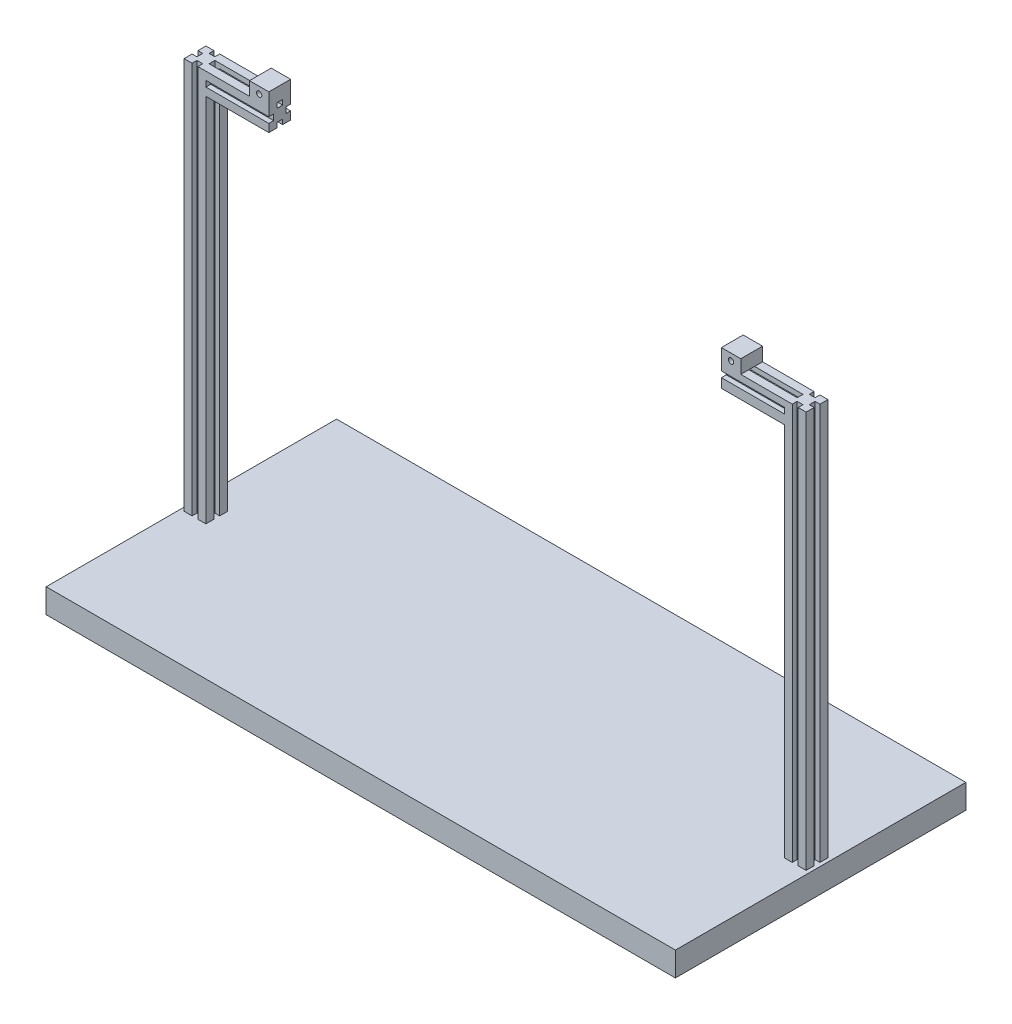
ISO-10303-21;
HEADER;
FILE_DESCRIPTION(('STEP AP214'),'2;1');
FILE_NAME('part.step','',(''),(''),'','','');
FILE_SCHEMA(('AUTOMOTIVE_DESIGN { 1 0 10303 214 1 1 1 1 }'));
ENDSEC;
DATA;
#1=APPLICATION_CONTEXT('core data for automotive mechanical design processes');
#2=APPLICATION_PROTOCOL_DEFINITION('international standard','automotive_design',2000,#1);
#3=PRODUCT_CONTEXT('',#1,'mechanical');
#4=PRODUCT('Part','Part','',(#3));
#5=PRODUCT_RELATED_PRODUCT_CATEGORY('part','',(#4));
#6=PRODUCT_DEFINITION_FORMATION('','',#4);
#7=PRODUCT_DEFINITION_CONTEXT('part definition',#1,'design');
#8=PRODUCT_DEFINITION('design','',#6,#7);
#9=PRODUCT_DEFINITION_SHAPE('','',#8);
#10=(LENGTH_UNIT() NAMED_UNIT(*) SI_UNIT(.MILLI.,.METRE.));
#11=(NAMED_UNIT(*) PLANE_ANGLE_UNIT() SI_UNIT($,.RADIAN.));
#12=(NAMED_UNIT(*) SI_UNIT($,.STERADIAN.) SOLID_ANGLE_UNIT());
#13=UNCERTAINTY_MEASURE_WITH_UNIT(LENGTH_MEASURE(1.E-05),#10,'distance_accuracy_value','');
#14=(GEOMETRIC_REPRESENTATION_CONTEXT(3) GLOBAL_UNCERTAINTY_ASSIGNED_CONTEXT((#13)) GLOBAL_UNIT_ASSIGNED_CONTEXT((#10,
#11,#12)) REPRESENTATION_CONTEXT('',''));
#15=CARTESIAN_POINT('',(0.,0.,0.));
#16=DIRECTION('',(0.,0.,1.));
#17=DIRECTION('',(1.,0.,0.));
#18=AXIS2_PLACEMENT_3D('',#15,#16,#17);
#19=CARTESIAN_POINT('',(-597.5,860.,0.));
#20=DIRECTION('',(1.,0.,0.));
#21=DIRECTION('',(0.,0.,-1.));
#22=AXIS2_PLACEMENT_3D('',#19,#20,#21);
#23=PLANE('',#22);
#24=DIRECTION('',(0.,-1.,0.));
#25=VECTOR('',#24,1.);
#26=CARTESIAN_POINT('',(-597.5,0.,12.5));
#27=LINE('',#26,#25);
#28=CARTESIAN_POINT('',(-597.5,843.5,12.5));
#29=VERTEX_POINT('',#28);
#30=CARTESIAN_POINT('',(-597.5,831.5,12.5));
#31=VERTEX_POINT('',#30);
#32=EDGE_CURVE('E734',#29,#31,#27,.T.);
#33=ORIENTED_EDGE('',*,*,#32,.F.);
#34=DIRECTION('',(0.,0.,-1.));
#35=VECTOR('',#34,1.);
#36=CARTESIAN_POINT('',(-597.5,843.5,0.));
#37=LINE('',#36,#35);
#38=CARTESIAN_POINT('',(-597.5,843.5,22.5));
#39=VERTEX_POINT('',#38);
#40=EDGE_CURVE('E731',#39,#29,#37,.T.);
#41=ORIENTED_EDGE('',*,*,#40,.F.);
#42=DIRECTION('',(0.,-1.,0.));
#43=VECTOR('',#42,1.);
#44=CARTESIAN_POINT('',(-597.5,860.,22.5));
#45=LINE('',#44,#43);
#46=CARTESIAN_POINT('',(-597.5,831.5,22.5));
#47=VERTEX_POINT('',#46);
#48=EDGE_CURVE('E1087',#39,#47,#45,.T.);
#49=ORIENTED_EDGE('',*,*,#48,.T.);
#50=DIRECTION('',(0.,0.,-1.));
#51=VECTOR('',#50,1.);
#52=CARTESIAN_POINT('',(-597.5,831.5,0.));
#53=LINE('',#52,#51);
#54=EDGE_CURVE('E742',#47,#31,#53,.T.);
#55=ORIENTED_EDGE('',*,*,#54,.T.);
#56=EDGE_LOOP('',(#33,#41,#49,#55));
#57=FACE_BOUND('',#56,.T.);
#58=ADVANCED_FACE('F35',(#57),#23,.T.);
#59=DIRECTION('',(0.,-1.,0.));
#60=VECTOR('',#59,1.);
#61=CARTESIAN_POINT('',(-597.5,0.,-12.5000000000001));
#62=LINE('',#61,#60);
#63=CARTESIAN_POINT('',(-597.5,843.5,-12.5));
#64=VERTEX_POINT('',#63);
#65=CARTESIAN_POINT('',(-597.5,831.5,-12.5));
#66=VERTEX_POINT('',#65);
#67=EDGE_CURVE('E754',#64,#66,#62,.T.);
#68=ORIENTED_EDGE('',*,*,#67,.T.);
#69=DIRECTION('',(0.,0.,1.));
#70=VECTOR('',#69,1.);
#71=CARTESIAN_POINT('',(-597.5,831.5,0.));
#72=LINE('',#71,#70);
#73=CARTESIAN_POINT('',(-597.5,831.5,-22.5));
#74=VERTEX_POINT('',#73);
#75=EDGE_CURVE('E751',#74,#66,#72,.T.);
#76=ORIENTED_EDGE('',*,*,#75,.F.);
#77=DIRECTION('',(0.,-1.,0.));
#78=VECTOR('',#77,1.);
#79=CARTESIAN_POINT('',(-597.5,860.,-22.5));
#80=LINE('',#79,#78);
#81=CARTESIAN_POINT('',(-597.5,843.5,-22.5));
#82=VERTEX_POINT('',#81);
#83=EDGE_CURVE('E1223',#82,#74,#80,.T.);
#84=ORIENTED_EDGE('',*,*,#83,.F.);
#85=DIRECTION('',(0.,0.,1.));
#86=VECTOR('',#85,1.);
#87=CARTESIAN_POINT('',(-597.5,843.5,0.));
#88=LINE('',#87,#86);
#89=EDGE_CURVE('E619',#82,#64,#88,.T.);
#90=ORIENTED_EDGE('',*,*,#89,.T.);
#91=EDGE_LOOP('',(#68,#76,#84,#90));
#92=FACE_BOUND('',#91,.T.);
#93=ADVANCED_FACE('F1363',(#92),#23,.T.);
#94=CARTESIAN_POINT('',(597.5,870.,-1.47412946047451E-12));
#95=DIRECTION('',(1.,0.,0.));
#96=DIRECTION('',(0.,0.,-1.));
#97=AXIS2_PLACEMENT_3D('',#94,#95,#96);
#98=PLANE('',#97);
#99=DIRECTION('',(0.,0.,1.));
#100=VECTOR('',#99,1.);
#101=CARTESIAN_POINT('',(597.5,825.,-1.51749672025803E-12));
#102=LINE('',#101,#100);
#103=CARTESIAN_POINT('',(597.5,825.,-22.5));
#104=VERTEX_POINT('',#103);
#105=CARTESIAN_POINT('',(597.5,825.,-5.99999999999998));
#106=VERTEX_POINT('',#105);
#107=EDGE_CURVE('E843',#104,#106,#102,.T.);
#108=ORIENTED_EDGE('',*,*,#107,.F.);
#109=DIRECTION('',(0.,-1.,0.));
#110=VECTOR('',#109,1.);
#111=CARTESIAN_POINT('',(597.5,870.,-22.5));
#112=LINE('',#111,#110);
#113=CARTESIAN_POINT('',(597.5,50.,-22.5));
#114=VERTEX_POINT('',#113);
#115=EDGE_CURVE('E1031',#104,#114,#112,.T.);
#116=ORIENTED_EDGE('',*,*,#115,.T.);
#117=DIRECTION('',(0.,0.,1.));
#118=VECTOR('',#117,1.);
#119=CARTESIAN_POINT('',(597.5,50.,-1.47412946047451E-12));
#120=LINE('',#119,#118);
#121=CARTESIAN_POINT('',(597.5,50.,-5.99999999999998));
#122=VERTEX_POINT('',#121);
#123=EDGE_CURVE('E958',#114,#122,#120,.T.);
#124=ORIENTED_EDGE('',*,*,#123,.T.);
#125=DIRECTION('',(0.,-1.,0.));
#126=VECTOR('',#125,1.);
#127=CARTESIAN_POINT('',(597.5,870.,-5.99999999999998));
#128=LINE('',#127,#126);
#129=EDGE_CURVE('E1029',#106,#122,#128,.T.);
#130=ORIENTED_EDGE('',*,*,#129,.F.);
#131=EDGE_LOOP('',(#108,#116,#124,#130));
#132=FACE_BOUND('',#131,.T.);
#133=ADVANCED_FACE('F1375',(#132),#98,.F.);
#134=DIRECTION('',(0.,0.,1.));
#135=VECTOR('',#134,1.);
#136=CARTESIAN_POINT('',(597.5,825.,-1.51749672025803E-12));
#137=LINE('',#136,#135);
#138=CARTESIAN_POINT('',(597.5,825.,6.00000000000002));
#139=VERTEX_POINT('',#138);
#140=CARTESIAN_POINT('',(597.5,825.,22.5));
#141=VERTEX_POINT('',#140);
#142=EDGE_CURVE('E848',#139,#141,#137,.T.);
#143=ORIENTED_EDGE('',*,*,#142,.F.);
#144=DIRECTION('',(0.,-1.,0.));
#145=VECTOR('',#144,1.);
#146=CARTESIAN_POINT('',(597.5,870.,6.00000000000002));
#147=LINE('',#146,#145);
#148=CARTESIAN_POINT('',(597.5,50.,6.00000000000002));
#149=VERTEX_POINT('',#148);
#150=EDGE_CURVE('E1021',#139,#149,#147,.T.);
#151=ORIENTED_EDGE('',*,*,#150,.T.);
#152=CARTESIAN_POINT('',(597.5,50.,22.5));
#153=VERTEX_POINT('',#152);
#154=EDGE_CURVE('E962',#149,#153,#120,.T.);
#155=ORIENTED_EDGE('',*,*,#154,.T.);
#156=DIRECTION('',(0.,-1.,0.));
#157=VECTOR('',#156,1.);
#158=CARTESIAN_POINT('',(597.5,870.,22.5));
#159=LINE('',#158,#157);
#160=EDGE_CURVE('E1018',#141,#153,#159,.T.);
#161=ORIENTED_EDGE('',*,*,#160,.F.);
#162=EDGE_LOOP('',(#143,#151,#155,#161));
#163=FACE_BOUND('',#162,.T.);
#164=ADVANCED_FACE('F1807',(#163),#98,.F.);
#165=DIRECTION('',(0.,0.,-1.));
#166=VECTOR('',#165,1.);
#167=CARTESIAN_POINT('',(597.5,844.165156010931,-1.51749672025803E-12));
#168=LINE('',#167,#166);
#169=CARTESIAN_POINT('',(597.5,844.165156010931,22.5));
#170=VERTEX_POINT('',#169);
#171=CARTESIAN_POINT('',(597.5,844.165156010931,12.5));
#172=VERTEX_POINT('',#171);
#173=EDGE_CURVE('E851',#170,#172,#168,.T.);
#174=ORIENTED_EDGE('',*,*,#173,.F.);
#175=CARTESIAN_POINT('',(597.5,856.165156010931,22.5));
#176=VERTEX_POINT('',#175);
#177=EDGE_CURVE('E1020',#176,#170,#159,.T.);
#178=ORIENTED_EDGE('',*,*,#177,.F.);
#179=DIRECTION('',(0.,0.,-1.));
#180=VECTOR('',#179,1.);
#181=CARTESIAN_POINT('',(597.5,856.165156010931,-1.51749672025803E-12));
#182=LINE('',#181,#180);
#183=CARTESIAN_POINT('',(597.5,856.165156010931,12.5));
#184=VERTEX_POINT('',#183);
#185=EDGE_CURVE('E857',#176,#184,#182,.T.);
#186=ORIENTED_EDGE('',*,*,#185,.T.);
#187=DIRECTION('',(0.,-1.,0.));
#188=VECTOR('',#187,1.);
#189=CARTESIAN_POINT('',(597.5,0.,12.5));
#190=LINE('',#189,#188);
#191=EDGE_CURVE('E854',#184,#172,#190,.T.);
#192=ORIENTED_EDGE('',*,*,#191,.T.);
#193=EDGE_LOOP('',(#174,#178,#186,#192));
#194=FACE_BOUND('',#193,.T.);
#195=ADVANCED_FACE('F1152',(#194),#98,.F.);
#196=CARTESIAN_POINT('',(0.,50.,0.));
#197=DIRECTION('',(0.,1.,0.));
#198=DIRECTION('',(0.,0.,1.));
#199=AXIS2_PLACEMENT_3D('',#196,#197,#198);
#200=PLANE('',#199);
#201=DIRECTION('',(1.,0.,0.));
#202=VECTOR('',#201,1.);
#203=CARTESIAN_POINT('',(0.,50.,-22.4999999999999));
#204=LINE('',#203,#202);
#205=CARTESIAN_POINT('',(626.,50.,-22.5));
#206=VERTEX_POINT('',#205);
#207=CARTESIAN_POINT('',(642.5,50.,-22.5));
#208=VERTEX_POINT('',#207);
#209=EDGE_CURVE('E904',#206,#208,#204,.T.);
#210=ORIENTED_EDGE('',*,*,#209,.T.);
#211=DIRECTION('',(0.,0.,1.));
#212=VECTOR('',#211,1.);
#213=CARTESIAN_POINT('',(642.5,50.,0.));
#214=LINE('',#213,#212);
#215=CARTESIAN_POINT('',(642.5,50.,-5.99999999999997));
#216=VERTEX_POINT('',#215);
#217=EDGE_CURVE('E910',#208,#216,#214,.T.);
#218=ORIENTED_EDGE('',*,*,#217,.T.);
#219=DIRECTION('',(-1.,0.,0.));
#220=VECTOR('',#219,1.);
#221=CARTESIAN_POINT('',(0.,50.,-5.99999999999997));
#222=LINE('',#221,#220);
#223=CARTESIAN_POINT('',(632.5,50.,-5.99999999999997));
#224=VERTEX_POINT('',#223);
#225=EDGE_CURVE('E986',#216,#224,#222,.T.);
#226=ORIENTED_EDGE('',*,*,#225,.T.);
#227=DIRECTION('',(0.,0.,1.));
#228=VECTOR('',#227,1.);
#229=CARTESIAN_POINT('',(632.5,50.,0.));
#230=LINE('',#229,#228);
#231=CARTESIAN_POINT('',(632.5,50.,6.00000000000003));
#232=VERTEX_POINT('',#231);
#233=EDGE_CURVE('E984',#224,#232,#230,.T.);
#234=ORIENTED_EDGE('',*,*,#233,.T.);
#235=DIRECTION('',(-1.,0.,0.));
#236=VECTOR('',#235,1.);
#237=CARTESIAN_POINT('',(0.,50.,6.00000000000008));
#238=LINE('',#237,#236);
#239=CARTESIAN_POINT('',(642.5,50.,6.00000000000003));
#240=VERTEX_POINT('',#239);
#241=EDGE_CURVE('E981',#240,#232,#238,.T.);
#242=ORIENTED_EDGE('',*,*,#241,.F.);
#243=CARTESIAN_POINT('',(642.5,50.,22.5));
#244=VERTEX_POINT('',#243);
#245=EDGE_CURVE('E979',#240,#244,#214,.T.);
#246=ORIENTED_EDGE('',*,*,#245,.T.);
#247=DIRECTION('',(1.,0.,0.));
#248=VECTOR('',#247,1.);
#249=CARTESIAN_POINT('',(0.,50.,22.5));
#250=LINE('',#249,#248);
#251=CARTESIAN_POINT('',(626.,50.,22.5));
#252=VERTEX_POINT('',#251);
#253=EDGE_CURVE('E972',#252,#244,#250,.T.);
#254=ORIENTED_EDGE('',*,*,#253,.F.);
#255=DIRECTION('',(0.,0.,-1.));
#256=VECTOR('',#255,1.);
#257=CARTESIAN_POINT('',(626.,50.,0.));
#258=LINE('',#257,#256);
#259=CARTESIAN_POINT('',(626.,50.,12.5));
#260=VERTEX_POINT('',#259);
#261=EDGE_CURVE('E977',#252,#260,#258,.T.);
#262=ORIENTED_EDGE('',*,*,#261,.T.);
#263=DIRECTION('',(-1.,0.,0.));
#264=VECTOR('',#263,1.);
#265=CARTESIAN_POINT('',(0.,50.,12.5000000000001));
#266=LINE('',#265,#264);
#267=CARTESIAN_POINT('',(614.,50.,12.5));
#268=VERTEX_POINT('',#267);
#269=EDGE_CURVE('E975',#260,#268,#266,.T.);
#270=ORIENTED_EDGE('',*,*,#269,.T.);
#271=DIRECTION('',(0.,0.,-1.));
#272=VECTOR('',#271,1.);
#273=CARTESIAN_POINT('',(614.,50.,0.));
#274=LINE('',#273,#272);
#275=CARTESIAN_POINT('',(614.,50.,22.5));
#276=VERTEX_POINT('',#275);
#277=EDGE_CURVE('E971',#276,#268,#274,.T.);
#278=ORIENTED_EDGE('',*,*,#277,.F.);
#279=EDGE_CURVE('E969',#153,#276,#250,.T.);
#280=ORIENTED_EDGE('',*,*,#279,.F.);
#281=ORIENTED_EDGE('',*,*,#154,.F.);
#282=DIRECTION('',(1.,0.,0.));
#283=VECTOR('',#282,1.);
#284=CARTESIAN_POINT('',(0.,50.,6.00000000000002));
#285=LINE('',#284,#283);
#286=CARTESIAN_POINT('',(607.5,50.,6.00000000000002));
#287=VERTEX_POINT('',#286);
#288=EDGE_CURVE('E967',#149,#287,#285,.T.);
#289=ORIENTED_EDGE('',*,*,#288,.T.);
#290=DIRECTION('',(0.,0.,-1.));
#291=VECTOR('',#290,1.);
#292=CARTESIAN_POINT('',(607.5,50.,0.));
#293=LINE('',#292,#291);
#294=CARTESIAN_POINT('',(607.5,50.,-5.99999999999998));
#295=VERTEX_POINT('',#294);
#296=EDGE_CURVE('E965',#287,#295,#293,.T.);
#297=ORIENTED_EDGE('',*,*,#296,.T.);
#298=DIRECTION('',(1.,0.,0.));
#299=VECTOR('',#298,1.);
#300=CARTESIAN_POINT('',(0.,50.,-5.99999999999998));
#301=LINE('',#300,#299);
#302=EDGE_CURVE('E961',#122,#295,#301,.T.);
#303=ORIENTED_EDGE('',*,*,#302,.F.);
#304=ORIENTED_EDGE('',*,*,#123,.F.);
#305=CARTESIAN_POINT('',(614.,50.,-22.5));
#306=VERTEX_POINT('',#305);
#307=EDGE_CURVE('E951',#114,#306,#204,.T.);
#308=ORIENTED_EDGE('',*,*,#307,.T.);
#309=DIRECTION('',(0.,0.,1.));
#310=VECTOR('',#309,1.);
#311=CARTESIAN_POINT('',(614.,50.,0.));
#312=LINE('',#311,#310);
#313=CARTESIAN_POINT('',(614.,50.,-12.5));
#314=VERTEX_POINT('',#313);
#315=EDGE_CURVE('E956',#306,#314,#312,.T.);
#316=ORIENTED_EDGE('',*,*,#315,.T.);
#317=DIRECTION('',(1.,0.,0.));
#318=VECTOR('',#317,1.);
#319=CARTESIAN_POINT('',(0.,50.,-12.4999999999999));
#320=LINE('',#319,#318);
#321=CARTESIAN_POINT('',(626.,50.,-12.5));
#322=VERTEX_POINT('',#321);
#323=EDGE_CURVE('E954',#314,#322,#320,.T.);
#324=ORIENTED_EDGE('',*,*,#323,.T.);
#325=DIRECTION('',(0.,0.,1.));
#326=VECTOR('',#325,1.);
#327=CARTESIAN_POINT('',(626.,50.,0.));
#328=LINE('',#327,#326);
#329=EDGE_CURVE('E950',#206,#322,#328,.T.);
#330=ORIENTED_EDGE('',*,*,#329,.F.);
#331=EDGE_LOOP('',(#210,#218,#226,#234,#242,#246,#254,#262,#270,#278,#280,#281,#289,#297,#303,
#304,#308,#316,#324,#330));
#332=FACE_BOUND('',#331,.T.);
#333=DIRECTION('',(0.,0.,1.));
#334=VECTOR('',#333,1.);
#335=CARTESIAN_POINT('',(-650.,50.,-300.));
#336=LINE('',#335,#334);
#337=CARTESIAN_POINT('',(-650.,50.,-300.));
#338=VERTEX_POINT('',#337);
#339=CARTESIAN_POINT('',(-650.,50.,300.));
#340=VERTEX_POINT('',#339);
#341=EDGE_CURVE('E1103',#338,#340,#336,.T.);
#342=ORIENTED_EDGE('',*,*,#341,.T.);
#343=DIRECTION('',(1.,0.,0.));
#344=VECTOR('',#343,1.);
#345=CARTESIAN_POINT('',(-650.,50.,300.));
#346=LINE('',#345,#344);
#347=CARTESIAN_POINT('',(650.,50.,300.));
#348=VERTEX_POINT('',#347);
#349=EDGE_CURVE('E1106',#340,#348,#346,.T.);
#350=ORIENTED_EDGE('',*,*,#349,.T.);
#351=DIRECTION('',(0.,0.,-1.));
#352=VECTOR('',#351,1.);
#353=CARTESIAN_POINT('',(650.,50.,-300.));
#354=LINE('',#353,#352);
#355=CARTESIAN_POINT('',(650.,50.,-300.));
#356=VERTEX_POINT('',#355);
#357=EDGE_CURVE('E1109',#348,#356,#354,.T.);
#358=ORIENTED_EDGE('',*,*,#357,.T.);
#359=DIRECTION('',(-1.,0.,0.));
#360=VECTOR('',#359,1.);
#361=CARTESIAN_POINT('',(-650.,50.,-300.));
#362=LINE('',#361,#360);
#363=EDGE_CURVE('E1111',#356,#338,#362,.T.);
#364=ORIENTED_EDGE('',*,*,#363,.T.);
#365=EDGE_LOOP('',(#342,#350,#358,#364));
#366=FACE_BOUND('',#365,.T.);
#367=DIRECTION('',(0.,0.,1.));
#368=VECTOR('',#367,1.);
#369=CARTESIAN_POINT('',(-632.5,50.,0.));
#370=LINE('',#369,#368);
#371=CARTESIAN_POINT('',(-632.5,50.,-5.99999999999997));
#372=VERTEX_POINT('',#371);
#373=CARTESIAN_POINT('',(-632.5,50.,6.00000000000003));
#374=VERTEX_POINT('',#373);
#375=EDGE_CURVE('E1159',#372,#374,#370,.T.);
#376=ORIENTED_EDGE('',*,*,#375,.F.);
#377=DIRECTION('',(1.,0.,0.));
#378=VECTOR('',#377,1.);
#379=CARTESIAN_POINT('',(0.,50.,-5.99999999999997));
#380=LINE('',#379,#378);
#381=CARTESIAN_POINT('',(-642.5,50.,-5.99999999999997));
#382=VERTEX_POINT('',#381);
#383=EDGE_CURVE('E1046',#382,#372,#380,.T.);
#384=ORIENTED_EDGE('',*,*,#383,.F.);
#385=DIRECTION('',(0.,0.,1.));
#386=VECTOR('',#385,1.);
#387=CARTESIAN_POINT('',(-642.5,50.,0.));
#388=LINE('',#387,#386);
#389=CARTESIAN_POINT('',(-642.5,50.,-22.5));
#390=VERTEX_POINT('',#389);
#391=EDGE_CURVE('E1051',#390,#382,#388,.T.);
#392=ORIENTED_EDGE('',*,*,#391,.F.);
#393=DIRECTION('',(1.,0.,0.));
#394=VECTOR('',#393,1.);
#395=CARTESIAN_POINT('',(0.,50.,-22.5));
#396=LINE('',#395,#394);
#397=CARTESIAN_POINT('',(-626.,50.,-22.5));
#398=VERTEX_POINT('',#397);
#399=EDGE_CURVE('E1198',#390,#398,#396,.T.);
#400=ORIENTED_EDGE('',*,*,#399,.T.);
#401=DIRECTION('',(0.,0.,1.));
#402=VECTOR('',#401,1.);
#403=CARTESIAN_POINT('',(-626.,50.,0.));
#404=LINE('',#403,#402);
#405=CARTESIAN_POINT('',(-626.,50.,-12.5));
#406=VERTEX_POINT('',#405);
#407=EDGE_CURVE('E1204',#398,#406,#404,.T.);
#408=ORIENTED_EDGE('',*,*,#407,.T.);
#409=DIRECTION('',(1.,0.,0.));
#410=VECTOR('',#409,1.);
#411=CARTESIAN_POINT('',(0.,50.,-12.5000000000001));
#412=LINE('',#411,#410);
#413=CARTESIAN_POINT('',(-614.,50.,-12.5));
#414=VERTEX_POINT('',#413);
#415=EDGE_CURVE('E1201',#406,#414,#412,.T.);
#416=ORIENTED_EDGE('',*,*,#415,.T.);
#417=DIRECTION('',(0.,0.,1.));
#418=VECTOR('',#417,1.);
#419=CARTESIAN_POINT('',(-614.,50.,0.));
#420=LINE('',#419,#418);
#421=CARTESIAN_POINT('',(-614.,50.,-22.5));
#422=VERTEX_POINT('',#421);
#423=EDGE_CURVE('E1197',#422,#414,#420,.T.);
#424=ORIENTED_EDGE('',*,*,#423,.F.);
#425=CARTESIAN_POINT('',(-597.5,50.,-22.5));
#426=VERTEX_POINT('',#425);
#427=EDGE_CURVE('E1194',#422,#426,#396,.T.);
#428=ORIENTED_EDGE('',*,*,#427,.T.);
#429=DIRECTION('',(0.,0.,1.));
#430=VECTOR('',#429,1.);
#431=CARTESIAN_POINT('',(-597.5,50.,0.));
#432=LINE('',#431,#430);
#433=CARTESIAN_POINT('',(-597.5,50.,-5.99999999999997));
#434=VERTEX_POINT('',#433);
#435=EDGE_CURVE('E1186',#426,#434,#432,.T.);
#436=ORIENTED_EDGE('',*,*,#435,.T.);
#437=DIRECTION('',(-1.,0.,0.));
#438=VECTOR('',#437,1.);
#439=CARTESIAN_POINT('',(0.,50.,-6.00000000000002));
#440=LINE('',#439,#438);
#441=CARTESIAN_POINT('',(-607.5,50.,-5.99999999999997));
#442=VERTEX_POINT('',#441);
#443=EDGE_CURVE('E1191',#434,#442,#440,.T.);
#444=ORIENTED_EDGE('',*,*,#443,.T.);
#445=DIRECTION('',(0.,0.,1.));
#446=VECTOR('',#445,1.);
#447=CARTESIAN_POINT('',(-607.5,50.,0.));
#448=LINE('',#447,#446);
#449=CARTESIAN_POINT('',(-607.5,50.,6.00000000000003));
#450=VERTEX_POINT('',#449);
#451=EDGE_CURVE('E1188',#442,#450,#448,.T.);
#452=ORIENTED_EDGE('',*,*,#451,.T.);
#453=DIRECTION('',(-1.,0.,0.));
#454=VECTOR('',#453,1.);
#455=CARTESIAN_POINT('',(0.,50.,5.99999999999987));
#456=LINE('',#455,#454);
#457=CARTESIAN_POINT('',(-597.5,50.,6.00000000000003));
#458=VERTEX_POINT('',#457);
#459=EDGE_CURVE('E1185',#458,#450,#456,.T.);
#460=ORIENTED_EDGE('',*,*,#459,.F.);
#461=CARTESIAN_POINT('',(-597.5,50.,22.5));
#462=VERTEX_POINT('',#461);
#463=EDGE_CURVE('E1182',#458,#462,#432,.T.);
#464=ORIENTED_EDGE('',*,*,#463,.T.);
#465=DIRECTION('',(1.,0.,0.));
#466=VECTOR('',#465,1.);
#467=CARTESIAN_POINT('',(0.,50.,22.5));
#468=LINE('',#467,#466);
#469=CARTESIAN_POINT('',(-614.,50.,22.5));
#470=VERTEX_POINT('',#469);
#471=EDGE_CURVE('E1177',#470,#462,#468,.T.);
#472=ORIENTED_EDGE('',*,*,#471,.F.);
#473=DIRECTION('',(0.,0.,-1.));
#474=VECTOR('',#473,1.);
#475=CARTESIAN_POINT('',(-614.,50.,0.));
#476=LINE('',#475,#474);
#477=CARTESIAN_POINT('',(-614.,50.,12.5));
#478=VERTEX_POINT('',#477);
#479=EDGE_CURVE('E1180',#470,#478,#476,.T.);
#480=ORIENTED_EDGE('',*,*,#479,.T.);
#481=DIRECTION('',(1.,0.,0.));
#482=VECTOR('',#481,1.);
#483=CARTESIAN_POINT('',(0.,50.,12.4999999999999));
#484=LINE('',#483,#482);
#485=CARTESIAN_POINT('',(-626.,50.,12.5));
#486=VERTEX_POINT('',#485);
#487=EDGE_CURVE('E1081',#486,#478,#484,.T.);
#488=ORIENTED_EDGE('',*,*,#487,.F.);
#489=DIRECTION('',(0.,0.,-1.));
#490=VECTOR('',#489,1.);
#491=CARTESIAN_POINT('',(-626.,50.,0.));
#492=LINE('',#491,#490);
#493=CARTESIAN_POINT('',(-626.,50.,22.5));
#494=VERTEX_POINT('',#493);
#495=EDGE_CURVE('E1176',#494,#486,#492,.T.);
#496=ORIENTED_EDGE('',*,*,#495,.F.);
#497=CARTESIAN_POINT('',(-642.5,50.,22.5));
#498=VERTEX_POINT('',#497);
#499=EDGE_CURVE('E1174',#498,#494,#468,.T.);
#500=ORIENTED_EDGE('',*,*,#499,.F.);
#501=CARTESIAN_POINT('',(-642.5,50.,6.00000000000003));
#502=VERTEX_POINT('',#501);
#503=EDGE_CURVE('E1168',#502,#498,#388,.T.);
#504=ORIENTED_EDGE('',*,*,#503,.F.);
#505=DIRECTION('',(1.,0.,0.));
#506=VECTOR('',#505,1.);
#507=CARTESIAN_POINT('',(0.,50.,5.99999999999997));
#508=LINE('',#507,#506);
#509=EDGE_CURVE('E1164',#502,#374,#508,.T.);
#510=ORIENTED_EDGE('',*,*,#509,.T.);
#511=EDGE_LOOP('',(#376,#384,#392,#400,#408,#416,#424,#428,#436,#444,#452,#460,#464,#472,#480,
#488,#496,#500,#504,#510));
#512=FACE_BOUND('',#511,.T.);
#513=ADVANCED_FACE('F1149',(#332,#366,#512),#200,.T.);
#514=CARTESIAN_POINT('',(-650.,50.,-300.));
#515=DIRECTION('',(1.,0.,0.));
#516=DIRECTION('',(0.,0.,-1.));
#517=AXIS2_PLACEMENT_3D('',#514,#515,#516);
#518=PLANE('',#517);
#519=DIRECTION('',(0.,0.,1.));
#520=VECTOR('',#519,1.);
#521=CARTESIAN_POINT('',(-650.,0.,-300.));
#522=LINE('',#521,#520);
#523=CARTESIAN_POINT('',(-650.,0.,-300.));
#524=VERTEX_POINT('',#523);
#525=CARTESIAN_POINT('',(-650.,0.,300.));
#526=VERTEX_POINT('',#525);
#527=EDGE_CURVE('E1102',#524,#526,#522,.T.);
#528=ORIENTED_EDGE('',*,*,#527,.T.);
#529=DIRECTION('',(0.,-1.,0.));
#530=VECTOR('',#529,1.);
#531=CARTESIAN_POINT('',(-650.,50.,300.));
#532=LINE('',#531,#530);
#533=EDGE_CURVE('E670',#340,#526,#532,.T.);
#534=ORIENTED_EDGE('',*,*,#533,.F.);
#535=ORIENTED_EDGE('',*,*,#341,.F.);
#536=DIRECTION('',(0.,-1.,0.));
#537=VECTOR('',#536,1.);
#538=CARTESIAN_POINT('',(-650.,50.,-300.));
#539=LINE('',#538,#537);
#540=EDGE_CURVE('E1113',#338,#524,#539,.T.);
#541=ORIENTED_EDGE('',*,*,#540,.T.);
#542=EDGE_LOOP('',(#528,#534,#535,#541));
#543=FACE_BOUND('',#542,.T.);
#544=ADVANCED_FACE('F37',(#543),#518,.F.);
#545=CARTESIAN_POINT('',(-650.,50.,300.));
#546=DIRECTION('',(0.,0.,-1.));
#547=DIRECTION('',(-1.,0.,0.));
#548=AXIS2_PLACEMENT_3D('',#545,#546,#547);
#549=PLANE('',#548);
#550=DIRECTION('',(1.,0.,0.));
#551=VECTOR('',#550,1.);
#552=CARTESIAN_POINT('',(-650.,0.,300.));
#553=LINE('',#552,#551);
#554=CARTESIAN_POINT('',(650.,0.,300.));
#555=VERTEX_POINT('',#554);
#556=EDGE_CURVE('E1116',#526,#555,#553,.T.);
#557=ORIENTED_EDGE('',*,*,#556,.T.);
#558=DIRECTION('',(0.,-1.,0.));
#559=VECTOR('',#558,1.);
#560=CARTESIAN_POINT('',(650.,50.,300.));
#561=LINE('',#560,#559);
#562=EDGE_CURVE('E1126',#348,#555,#561,.T.);
#563=ORIENTED_EDGE('',*,*,#562,.F.);
#564=ORIENTED_EDGE('',*,*,#349,.F.);
#565=ORIENTED_EDGE('',*,*,#533,.T.);
#566=EDGE_LOOP('',(#557,#563,#564,#565));
#567=FACE_BOUND('',#566,.T.);
#568=ADVANCED_FACE('F1131',(#567),#549,.F.);
#569=CARTESIAN_POINT('',(650.,50.,-300.));
#570=DIRECTION('',(-1.,0.,0.));
#571=DIRECTION('',(0.,0.,1.));
#572=AXIS2_PLACEMENT_3D('',#569,#570,#571);
#573=PLANE('',#572);
#574=DIRECTION('',(0.,0.,-1.));
#575=VECTOR('',#574,1.);
#576=CARTESIAN_POINT('',(650.,0.,-300.));
#577=LINE('',#576,#575);
#578=CARTESIAN_POINT('',(650.,0.,-300.));
#579=VERTEX_POINT('',#578);
#580=EDGE_CURVE('E1118',#555,#579,#577,.T.);
#581=ORIENTED_EDGE('',*,*,#580,.T.);
#582=DIRECTION('',(0.,-1.,0.));
#583=VECTOR('',#582,1.);
#584=CARTESIAN_POINT('',(650.,50.,-300.));
#585=LINE('',#584,#583);
#586=EDGE_CURVE('E1123',#356,#579,#585,.T.);
#587=ORIENTED_EDGE('',*,*,#586,.F.);
#588=ORIENTED_EDGE('',*,*,#357,.F.);
#589=ORIENTED_EDGE('',*,*,#562,.T.);
#590=EDGE_LOOP('',(#581,#587,#588,#589));
#591=FACE_BOUND('',#590,.T.);
#592=ADVANCED_FACE('F1143',(#591),#573,.F.);
#593=CARTESIAN_POINT('',(-650.,50.,-300.));
#594=DIRECTION('',(0.,0.,1.));
#595=DIRECTION('',(1.,0.,0.));
#596=AXIS2_PLACEMENT_3D('',#593,#594,#595);
#597=PLANE('',#596);
#598=DIRECTION('',(-1.,0.,0.));
#599=VECTOR('',#598,1.);
#600=CARTESIAN_POINT('',(-650.,0.,-300.));
#601=LINE('',#600,#599);
#602=EDGE_CURVE('E1107',#579,#524,#601,.T.);
#603=ORIENTED_EDGE('',*,*,#602,.T.);
#604=ORIENTED_EDGE('',*,*,#540,.F.);
#605=ORIENTED_EDGE('',*,*,#363,.F.);
#606=ORIENTED_EDGE('',*,*,#586,.T.);
#607=EDGE_LOOP('',(#603,#604,#605,#606));
#608=FACE_BOUND('',#607,.T.);
#609=ADVANCED_FACE('F1147',(#608),#597,.F.);
#610=CARTESIAN_POINT('',(0.,0.,0.));
#611=DIRECTION('',(0.,1.,0.));
#612=DIRECTION('',(0.,0.,1.));
#613=AXIS2_PLACEMENT_3D('',#610,#611,#612);
#614=PLANE('',#613);
#615=ORIENTED_EDGE('',*,*,#527,.F.);
#616=ORIENTED_EDGE('',*,*,#602,.F.);
#617=ORIENTED_EDGE('',*,*,#580,.F.);
#618=ORIENTED_EDGE('',*,*,#556,.F.);
#619=EDGE_LOOP('',(#615,#616,#617,#618));
#620=FACE_BOUND('',#619,.T.);
#621=ADVANCED_FACE('F1139',(#620),#614,.F.);
#622=CARTESIAN_POINT('',(0.,860.,-5.99999999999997));
#623=DIRECTION('',(0.,0.,-1.));
#624=DIRECTION('',(-1.,0.,0.));
#625=AXIS2_PLACEMENT_3D('',#622,#623,#624);
#626=PLANE('',#625);
#627=ORIENTED_EDGE('',*,*,#383,.T.);
#628=DIRECTION('',(0.,-1.,0.));
#629=VECTOR('',#628,1.);
#630=CARTESIAN_POINT('',(-632.5,860.,-5.99999999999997));
#631=LINE('',#630,#629);
#632=CARTESIAN_POINT('',(-632.5,860.,-5.99999999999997));
#633=VERTEX_POINT('',#632);
#634=EDGE_CURVE('E1100',#633,#372,#631,.T.);
#635=ORIENTED_EDGE('',*,*,#634,.F.);
#636=DIRECTION('',(1.,0.,0.));
#637=VECTOR('',#636,1.);
#638=CARTESIAN_POINT('',(0.,860.,-5.99999999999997));
#639=LINE('',#638,#637);
#640=CARTESIAN_POINT('',(-642.5,860.,-5.99999999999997));
#641=VERTEX_POINT('',#640);
#642=EDGE_CURVE('E1047',#641,#633,#639,.T.);
#643=ORIENTED_EDGE('',*,*,#642,.F.);
#644=DIRECTION('',(0.,-1.,0.));
#645=VECTOR('',#644,1.);
#646=CARTESIAN_POINT('',(-642.5,860.,-5.99999999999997));
#647=LINE('',#646,#645);
#648=EDGE_CURVE('E1207',#641,#382,#647,.T.);
#649=ORIENTED_EDGE('',*,*,#648,.T.);
#650=EDGE_LOOP('',(#627,#635,#643,#649));
#651=FACE_BOUND('',#650,.T.);
#652=ADVANCED_FACE('F1298',(#651),#626,.F.);
#653=CARTESIAN_POINT('',(-632.5,860.,0.));
#654=DIRECTION('',(1.,0.,0.));
#655=DIRECTION('',(0.,0.,-1.));
#656=AXIS2_PLACEMENT_3D('',#653,#654,#655);
#657=PLANE('',#656);
#658=ORIENTED_EDGE('',*,*,#375,.T.);
#659=DIRECTION('',(0.,-1.,0.));
#660=VECTOR('',#659,1.);
#661=CARTESIAN_POINT('',(-632.5,860.,6.00000000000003));
#662=LINE('',#661,#660);
#663=CARTESIAN_POINT('',(-632.5,860.,6.00000000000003));
#664=VERTEX_POINT('',#663);
#665=EDGE_CURVE('E1098',#664,#374,#662,.T.);
#666=ORIENTED_EDGE('',*,*,#665,.F.);
#667=DIRECTION('',(0.,0.,1.));
#668=VECTOR('',#667,1.);
#669=CARTESIAN_POINT('',(-632.5,860.,0.));
#670=LINE('',#669,#668);
#671=EDGE_CURVE('E1050',#633,#664,#670,.T.);
#672=ORIENTED_EDGE('',*,*,#671,.F.);
#673=ORIENTED_EDGE('',*,*,#634,.T.);
#674=EDGE_LOOP('',(#658,#666,#672,#673));
#675=FACE_BOUND('',#674,.T.);
#676=ADVANCED_FACE('F1299',(#675),#657,.F.);
#677=CARTESIAN_POINT('',(0.,860.,5.99999999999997));
#678=DIRECTION('',(0.,0.,-1.));
#679=DIRECTION('',(-1.,0.,0.));
#680=AXIS2_PLACEMENT_3D('',#677,#678,#679);
#681=PLANE('',#680);
#682=ORIENTED_EDGE('',*,*,#509,.F.);
#683=DIRECTION('',(0.,-1.,0.));
#684=VECTOR('',#683,1.);
#685=CARTESIAN_POINT('',(-642.5,860.,6.00000000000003));
#686=LINE('',#685,#684);
#687=CARTESIAN_POINT('',(-642.5,860.,6.00000000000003));
#688=VERTEX_POINT('',#687);
#689=EDGE_CURVE('E1096',#688,#502,#686,.T.);
#690=ORIENTED_EDGE('',*,*,#689,.F.);
#691=DIRECTION('',(1.,0.,0.));
#692=VECTOR('',#691,1.);
#693=CARTESIAN_POINT('',(0.,860.,5.99999999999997));
#694=LINE('',#693,#692);
#695=EDGE_CURVE('E1053',#688,#664,#694,.T.);
#696=ORIENTED_EDGE('',*,*,#695,.T.);
#697=ORIENTED_EDGE('',*,*,#665,.T.);
#698=EDGE_LOOP('',(#682,#690,#696,#697));
#699=FACE_BOUND('',#698,.T.);
#700=ADVANCED_FACE('F1301',(#699),#681,.T.);
#701=CARTESIAN_POINT('',(-642.5,860.,0.));
#702=DIRECTION('',(1.,0.,0.));
#703=DIRECTION('',(0.,0.,-1.));
#704=AXIS2_PLACEMENT_3D('',#701,#702,#703);
#705=PLANE('',#704);
#706=ORIENTED_EDGE('',*,*,#503,.T.);
#707=DIRECTION('',(0.,-1.,0.));
#708=VECTOR('',#707,1.);
#709=CARTESIAN_POINT('',(-642.5,860.,22.5));
#710=LINE('',#709,#708);
#711=CARTESIAN_POINT('',(-642.5,860.,22.5));
#712=VERTEX_POINT('',#711);
#713=EDGE_CURVE('E1093',#712,#498,#710,.T.);
#714=ORIENTED_EDGE('',*,*,#713,.F.);
#715=DIRECTION('',(0.,0.,1.));
#716=VECTOR('',#715,1.);
#717=CARTESIAN_POINT('',(-642.5,860.,0.));
#718=LINE('',#717,#716);
#719=EDGE_CURVE('E1056',#688,#712,#718,.T.);
#720=ORIENTED_EDGE('',*,*,#719,.F.);
#721=ORIENTED_EDGE('',*,*,#689,.T.);
#722=EDGE_LOOP('',(#706,#714,#720,#721));
#723=FACE_BOUND('',#722,.T.);
#724=ADVANCED_FACE('F1307',(#723),#705,.F.);
#725=CARTESIAN_POINT('',(0.,860.,22.5));
#726=DIRECTION('',(0.,0.,-1.));
#727=DIRECTION('',(-1.,0.,0.));
#728=AXIS2_PLACEMENT_3D('',#725,#726,#727);
#729=PLANE('',#728);
#730=ORIENTED_EDGE('',*,*,#499,.T.);
#731=DIRECTION('',(0.,-1.,0.));
#732=VECTOR('',#731,1.);
#733=CARTESIAN_POINT('',(-626.,860.,22.5));
#734=LINE('',#733,#732);
#735=CARTESIAN_POINT('',(-626.,860.,22.5));
#736=VERTEX_POINT('',#735);
#737=EDGE_CURVE('E1085',#736,#494,#734,.T.);
#738=ORIENTED_EDGE('',*,*,#737,.F.);
#739=DIRECTION('',(1.,0.,0.));
#740=VECTOR('',#739,1.);
#741=CARTESIAN_POINT('',(0.,860.,22.5));
#742=LINE('',#741,#740);
#743=EDGE_CURVE('E1057',#712,#736,#742,.T.);
#744=ORIENTED_EDGE('',*,*,#743,.F.);
#745=ORIENTED_EDGE('',*,*,#713,.T.);
#746=EDGE_LOOP('',(#730,#738,#744,#745));
#747=FACE_BOUND('',#746,.T.);
#748=ADVANCED_FACE('F1310',(#747),#729,.F.);
#749=CARTESIAN_POINT('',(-626.,860.,0.));
#750=DIRECTION('',(-1.,0.,0.));
#751=DIRECTION('',(0.,0.,1.));
#752=AXIS2_PLACEMENT_3D('',#749,#750,#751);
#753=PLANE('',#752);
#754=ORIENTED_EDGE('',*,*,#495,.T.);
#755=DIRECTION('',(0.,-1.,0.));
#756=VECTOR('',#755,1.);
#757=CARTESIAN_POINT('',(-626.,860.,12.5));
#758=LINE('',#757,#756);
#759=CARTESIAN_POINT('',(-626.,860.,12.5));
#760=VERTEX_POINT('',#759);
#761=EDGE_CURVE('E1083',#760,#486,#758,.T.);
#762=ORIENTED_EDGE('',*,*,#761,.F.);
#763=DIRECTION('',(0.,0.,-1.));
#764=VECTOR('',#763,1.);
#765=CARTESIAN_POINT('',(-626.,860.,0.));
#766=LINE('',#765,#764);
#767=EDGE_CURVE('E1060',#736,#760,#766,.T.);
#768=ORIENTED_EDGE('',*,*,#767,.F.);
#769=ORIENTED_EDGE('',*,*,#737,.T.);
#770=EDGE_LOOP('',(#754,#762,#768,#769));
#771=FACE_BOUND('',#770,.T.);
#772=ADVANCED_FACE('F1313',(#771),#753,.F.);
#773=CARTESIAN_POINT('',(0.,860.,12.4999999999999));
#774=DIRECTION('',(0.,0.,-1.));
#775=DIRECTION('',(-1.,0.,0.));
#776=AXIS2_PLACEMENT_3D('',#773,#774,#775);
#777=PLANE('',#776);
#778=ORIENTED_EDGE('',*,*,#487,.T.);
#779=DIRECTION('',(0.,-1.,0.));
#780=VECTOR('',#779,1.);
#781=CARTESIAN_POINT('',(-614.,860.,12.5));
#782=LINE('',#781,#780);
#783=CARTESIAN_POINT('',(-614.,860.,12.5));
#784=VERTEX_POINT('',#783);
#785=EDGE_CURVE('E1071',#784,#478,#782,.T.);
#786=ORIENTED_EDGE('',*,*,#785,.F.);
#787=DIRECTION('',(1.,0.,0.));
#788=VECTOR('',#787,1.);
#789=CARTESIAN_POINT('',(0.,860.,12.4999999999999));
#790=LINE('',#789,#788);
#791=EDGE_CURVE('E1062',#760,#784,#790,.T.);
#792=ORIENTED_EDGE('',*,*,#791,.F.);
#793=ORIENTED_EDGE('',*,*,#761,.T.);
#794=EDGE_LOOP('',(#778,#786,#792,#793));
#795=FACE_BOUND('',#794,.T.);
#796=ADVANCED_FACE('F1079',(#795),#777,.F.);
#797=CARTESIAN_POINT('',(-614.,860.,0.));
#798=DIRECTION('',(-1.,0.,0.));
#799=DIRECTION('',(0.,0.,1.));
#800=AXIS2_PLACEMENT_3D('',#797,#798,#799);
#801=PLANE('',#800);
#802=ORIENTED_EDGE('',*,*,#479,.F.);
#803=DIRECTION('',(0.,-1.,0.));
#804=VECTOR('',#803,1.);
#805=CARTESIAN_POINT('',(-614.,860.,22.5));
#806=LINE('',#805,#804);
#807=CARTESIAN_POINT('',(-614.,860.,22.5));
#808=VERTEX_POINT('',#807);
#809=EDGE_CURVE('E1073',#808,#470,#806,.T.);
#810=ORIENTED_EDGE('',*,*,#809,.F.);
#811=DIRECTION('',(0.,0.,-1.));
#812=VECTOR('',#811,1.);
#813=CARTESIAN_POINT('',(-614.,860.,0.));
#814=LINE('',#813,#812);
#815=EDGE_CURVE('E1064',#808,#784,#814,.T.);
#816=ORIENTED_EDGE('',*,*,#815,.T.);
#817=ORIENTED_EDGE('',*,*,#785,.T.);
#818=EDGE_LOOP('',(#802,#810,#816,#817));
#819=FACE_BOUND('',#818,.T.);
#820=ADVANCED_FACE('F1069',(#819),#801,.T.);
#821=CARTESIAN_POINT('',(-487.5,874.,22.5));
#822=DIRECTION('',(0.,0.,1.));
#823=DIRECTION('',(1.,0.,0.));
#824=AXIS2_PLACEMENT_3D('',#821,#822,#823);
#825=CIRCLE('',#824,5.50000000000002);
#826=CARTESIAN_POINT('',(-482.,874.,22.5));
#827=VERTEX_POINT('',#826);
#828=EDGE_CURVE('E593',#827,#827,#825,.T.);
#829=ORIENTED_EDGE('',*,*,#828,.F.);
#830=EDGE_LOOP('',(#829));
#831=FACE_BOUND('',#830,.T.);
#832=ORIENTED_EDGE('',*,*,#471,.T.);
#833=CARTESIAN_POINT('',(-597.5,815.,22.5));
#834=VERTEX_POINT('',#833);
#835=EDGE_CURVE('E1229',#834,#462,#45,.T.);
#836=ORIENTED_EDGE('',*,*,#835,.F.);
#837=DIRECTION('',(-1.,0.,0.));
#838=VECTOR('',#837,1.);
#839=CARTESIAN_POINT('',(-467.5,815.,22.5));
#840=LINE('',#839,#838);
#841=CARTESIAN_POINT('',(-467.5,815.,22.5));
#842=VERTEX_POINT('',#841);
#843=EDGE_CURVE('E784',#842,#834,#840,.T.);
#844=ORIENTED_EDGE('',*,*,#843,.F.);
#845=DIRECTION('',(0.,-1.,0.));
#846=VECTOR('',#845,1.);
#847=CARTESIAN_POINT('',(-467.5,0.,22.5));
#848=LINE('',#847,#846);
#849=CARTESIAN_POINT('',(-467.5,831.5,22.5));
#850=VERTEX_POINT('',#849);
#851=EDGE_CURVE('E1239',#850,#842,#848,.T.);
#852=ORIENTED_EDGE('',*,*,#851,.F.);
#853=DIRECTION('',(-1.,0.,0.));
#854=VECTOR('',#853,1.);
#855=CARTESIAN_POINT('',(-467.5,831.5,22.5));
#856=LINE('',#855,#854);
#857=EDGE_CURVE('E787',#850,#47,#856,.T.);
#858=ORIENTED_EDGE('',*,*,#857,.T.);
#859=ORIENTED_EDGE('',*,*,#48,.F.);
#860=DIRECTION('',(-1.,0.,0.));
#861=VECTOR('',#860,1.);
#862=CARTESIAN_POINT('',(-467.5,843.5,22.5));
#863=LINE('',#862,#861);
#864=CARTESIAN_POINT('',(-467.5,843.5,22.5));
#865=VERTEX_POINT('',#864);
#866=EDGE_CURVE('E724',#865,#39,#863,.T.);
#867=ORIENTED_EDGE('',*,*,#866,.F.);
#868=CARTESIAN_POINT('',(-467.5,888.,22.5));
#869=VERTEX_POINT('',#868);
#870=EDGE_CURVE('E625',#869,#865,#848,.T.);
#871=ORIENTED_EDGE('',*,*,#870,.F.);
#872=DIRECTION('',(1.,0.,0.));
#873=VECTOR('',#872,1.);
#874=CARTESIAN_POINT('',(-467.5,888.,22.5));
#875=LINE('',#874,#873);
#876=CARTESIAN_POINT('',(-507.5,888.,22.5));
#877=VERTEX_POINT('',#876);
#878=EDGE_CURVE('E604',#877,#869,#875,.T.);
#879=ORIENTED_EDGE('',*,*,#878,.F.);
#880=DIRECTION('',(0.,-1.,0.));
#881=VECTOR('',#880,1.);
#882=CARTESIAN_POINT('',(-507.5,888.,22.5));
#883=LINE('',#882,#881);
#884=CARTESIAN_POINT('',(-507.5,860.,22.5));
#885=VERTEX_POINT('',#884);
#886=EDGE_CURVE('E607',#877,#885,#883,.T.);
#887=ORIENTED_EDGE('',*,*,#886,.T.);
#888=EDGE_CURVE('E665',#808,#885,#742,.T.);
#889=ORIENTED_EDGE('',*,*,#888,.F.);
#890=ORIENTED_EDGE('',*,*,#809,.T.);
#891=EDGE_LOOP('',(#832,#836,#844,#852,#858,#859,#867,#871,#879,#887,#889,#890));
#892=FACE_BOUND('',#891,.T.);
#893=ADVANCED_FACE('F678',(#831,#892),#729,.F.);
#894=DIRECTION('',(0.,0.,1.));
#895=VECTOR('',#894,1.);
#896=CARTESIAN_POINT('',(-597.5,815.,0.));
#897=LINE('',#896,#895);
#898=CARTESIAN_POINT('',(-597.5,815.,6.00000000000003));
#899=VERTEX_POINT('',#898);
#900=EDGE_CURVE('E744',#899,#834,#897,.T.);
#901=ORIENTED_EDGE('',*,*,#900,.T.);
#902=ORIENTED_EDGE('',*,*,#835,.T.);
#903=ORIENTED_EDGE('',*,*,#463,.F.);
#904=DIRECTION('',(0.,-1.,0.));
#905=VECTOR('',#904,1.);
#906=CARTESIAN_POINT('',(-597.5,860.,6.00000000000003));
#907=LINE('',#906,#905);
#908=EDGE_CURVE('E1228',#899,#458,#907,.T.);
#909=ORIENTED_EDGE('',*,*,#908,.F.);
#910=EDGE_LOOP('',(#901,#902,#903,#909));
#911=FACE_BOUND('',#910,.T.);
#912=ADVANCED_FACE('F1360',(#911),#23,.T.);
#913=CARTESIAN_POINT('',(0.,860.,5.99999999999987));
#914=DIRECTION('',(0.,0.,1.));
#915=DIRECTION('',(1.,0.,0.));
#916=AXIS2_PLACEMENT_3D('',#913,#914,#915);
#917=PLANE('',#916);
#918=ORIENTED_EDGE('',*,*,#459,.T.);
#919=DIRECTION('',(0.,-1.,0.));
#920=VECTOR('',#919,1.);
#921=CARTESIAN_POINT('',(-607.5,860.,6.00000000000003));
#922=LINE('',#921,#920);
#923=CARTESIAN_POINT('',(-607.5,860.,6.00000000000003));
#924=VERTEX_POINT('',#923);
#925=EDGE_CURVE('E696',#924,#450,#922,.T.);
#926=ORIENTED_EDGE('',*,*,#925,.F.);
#927=DIRECTION('',(-1.,0.,0.));
#928=VECTOR('',#927,1.);
#929=CARTESIAN_POINT('',(0.,860.,5.99999999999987));
#930=LINE('',#929,#928);
#931=CARTESIAN_POINT('',(-507.5,860.,6.));
#932=VERTEX_POINT('',#931);
#933=EDGE_CURVE('E689',#932,#924,#930,.T.);
#934=ORIENTED_EDGE('',*,*,#933,.F.);
#935=CARTESIAN_POINT('',(-467.5,860.,6.00000000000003));
#936=VERTEX_POINT('',#935);
#937=EDGE_CURVE('E631',#936,#932,#930,.T.);
#938=ORIENTED_EDGE('',*,*,#937,.F.);
#939=DIRECTION('',(0.,1.,0.));
#940=VECTOR('',#939,1.);
#941=CARTESIAN_POINT('',(-467.5,0.,6.00000000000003));
#942=LINE('',#941,#940);
#943=CARTESIAN_POINT('',(-467.5,850.,6.00000000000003));
#944=VERTEX_POINT('',#943);
#945=EDGE_CURVE('E618',#944,#936,#942,.T.);
#946=ORIENTED_EDGE('',*,*,#945,.F.);
#947=DIRECTION('',(-1.,0.,0.));
#948=VECTOR('',#947,1.);
#949=CARTESIAN_POINT('',(-467.5,850.,6.00000000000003));
#950=LINE('',#949,#948);
#951=CARTESIAN_POINT('',(-597.5,850.,6.00000000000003));
#952=VERTEX_POINT('',#951);
#953=EDGE_CURVE('E717',#944,#952,#950,.T.);
#954=ORIENTED_EDGE('',*,*,#953,.T.);
#955=DIRECTION('',(0.,1.,0.));
#956=VECTOR('',#955,1.);
#957=CARTESIAN_POINT('',(-597.5,860.,6.00000000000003));
#958=LINE('',#957,#956);
#959=CARTESIAN_POINT('',(-597.5,825.,6.00000000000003));
#960=VERTEX_POINT('',#959);
#961=EDGE_CURVE('E720',#960,#952,#958,.T.);
#962=ORIENTED_EDGE('',*,*,#961,.F.);
#963=DIRECTION('',(-1.,0.,0.));
#964=VECTOR('',#963,1.);
#965=CARTESIAN_POINT('',(-467.5,825.,6.00000000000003));
#966=LINE('',#965,#964);
#967=CARTESIAN_POINT('',(-467.5,825.,6.00000000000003));
#968=VERTEX_POINT('',#967);
#969=EDGE_CURVE('E779',#968,#960,#966,.T.);
#970=ORIENTED_EDGE('',*,*,#969,.F.);
#971=CARTESIAN_POINT('',(-467.5,815.,6.00000000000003));
#972=VERTEX_POINT('',#971);
#973=EDGE_CURVE('E620',#972,#968,#942,.T.);
#974=ORIENTED_EDGE('',*,*,#973,.F.);
#975=DIRECTION('',(-1.,0.,0.));
#976=VECTOR('',#975,1.);
#977=CARTESIAN_POINT('',(-467.5,815.,6.00000000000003));
#978=LINE('',#977,#976);
#979=EDGE_CURVE('E781',#972,#899,#978,.T.);
#980=ORIENTED_EDGE('',*,*,#979,.T.);
#981=ORIENTED_EDGE('',*,*,#908,.T.);
#982=EDGE_LOOP('',(#918,#926,#934,#938,#946,#954,#962,#970,#974,#980,#981));
#983=FACE_BOUND('',#982,.T.);
#984=ADVANCED_FACE('F694',(#983),#917,.F.);
#985=CARTESIAN_POINT('',(-607.5,860.,0.));
#986=DIRECTION('',(1.,0.,0.));
#987=DIRECTION('',(0.,0.,-1.));
#988=AXIS2_PLACEMENT_3D('',#985,#986,#987);
#989=PLANE('',#988);
#990=ORIENTED_EDGE('',*,*,#451,.F.);
#991=DIRECTION('',(0.,-1.,0.));
#992=VECTOR('',#991,1.);
#993=CARTESIAN_POINT('',(-607.5,860.,-5.99999999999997));
#994=LINE('',#993,#992);
#995=CARTESIAN_POINT('',(-607.5,860.,-5.99999999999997));
#996=VERTEX_POINT('',#995);
#997=EDGE_CURVE('E706',#996,#442,#994,.T.);
#998=ORIENTED_EDGE('',*,*,#997,.F.);
#999=DIRECTION('',(0.,0.,1.));
#1000=VECTOR('',#999,1.);
#1001=CARTESIAN_POINT('',(-607.5,860.,0.));
#1002=LINE('',#1001,#1000);
#1003=EDGE_CURVE('E652',#996,#924,#1002,.T.);
#1004=ORIENTED_EDGE('',*,*,#1003,.T.);
#1005=ORIENTED_EDGE('',*,*,#925,.T.);
#1006=EDGE_LOOP('',(#990,#998,#1004,#1005));
#1007=FACE_BOUND('',#1006,.T.);
#1008=ADVANCED_FACE('F705',(#1007),#989,.T.);
#1009=CARTESIAN_POINT('',(0.,860.,-6.00000000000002));
#1010=DIRECTION('',(0.,0.,1.));
#1011=DIRECTION('',(1.,0.,0.));
#1012=AXIS2_PLACEMENT_3D('',#1009,#1010,#1011);
#1013=PLANE('',#1012);
#1014=ORIENTED_EDGE('',*,*,#443,.F.);
#1015=DIRECTION('',(0.,-1.,0.));
#1016=VECTOR('',#1015,1.);
#1017=CARTESIAN_POINT('',(-597.5,860.,-5.99999999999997));
#1018=LINE('',#1017,#1016);
#1019=CARTESIAN_POINT('',(-597.5,815.,-5.99999999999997));
#1020=VERTEX_POINT('',#1019);
#1021=EDGE_CURVE('E1224',#1020,#434,#1018,.T.);
#1022=ORIENTED_EDGE('',*,*,#1021,.F.);
#1023=DIRECTION('',(-1.,0.,0.));
#1024=VECTOR('',#1023,1.);
#1025=CARTESIAN_POINT('',(-467.5,815.,-5.99999999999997));
#1026=LINE('',#1025,#1024);
#1027=CARTESIAN_POINT('',(-467.5,815.,-5.99999999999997));
#1028=VERTEX_POINT('',#1027);
#1029=EDGE_CURVE('E773',#1028,#1020,#1026,.T.);
#1030=ORIENTED_EDGE('',*,*,#1029,.F.);
#1031=DIRECTION('',(0.,1.,0.));
#1032=VECTOR('',#1031,1.);
#1033=CARTESIAN_POINT('',(-467.5,0.,-5.99999999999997));
#1034=LINE('',#1033,#1032);
#1035=CARTESIAN_POINT('',(-467.5,825.,-5.99999999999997));
#1036=VERTEX_POINT('',#1035);
#1037=EDGE_CURVE('E1328',#1028,#1036,#1034,.T.);
#1038=ORIENTED_EDGE('',*,*,#1037,.T.);
#1039=DIRECTION('',(-1.,0.,0.));
#1040=VECTOR('',#1039,1.);
#1041=CARTESIAN_POINT('',(-467.5,825.,-5.99999999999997));
#1042=LINE('',#1041,#1040);
#1043=CARTESIAN_POINT('',(-597.5,825.,-5.99999999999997));
#1044=VERTEX_POINT('',#1043);
#1045=EDGE_CURVE('E776',#1036,#1044,#1042,.T.);
#1046=ORIENTED_EDGE('',*,*,#1045,.T.);
#1047=DIRECTION('',(0.,1.,0.));
#1048=VECTOR('',#1047,1.);
#1049=CARTESIAN_POINT('',(-597.5,860.,-5.99999999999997));
#1050=LINE('',#1049,#1048);
#1051=CARTESIAN_POINT('',(-597.5,850.,-5.99999999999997));
#1052=VERTEX_POINT('',#1051);
#1053=EDGE_CURVE('E723',#1044,#1052,#1050,.T.);
#1054=ORIENTED_EDGE('',*,*,#1053,.T.);
#1055=DIRECTION('',(-1.,0.,0.));
#1056=VECTOR('',#1055,1.);
#1057=CARTESIAN_POINT('',(-467.5,850.,-5.99999999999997));
#1058=LINE('',#1057,#1056);
#1059=CARTESIAN_POINT('',(-467.5,850.,-5.99999999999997));
#1060=VERTEX_POINT('',#1059);
#1061=EDGE_CURVE('E729',#1060,#1052,#1058,.T.);
#1062=ORIENTED_EDGE('',*,*,#1061,.F.);
#1063=DIRECTION('',(0.,-1.,0.));
#1064=VECTOR('',#1063,1.);
#1065=CARTESIAN_POINT('',(-467.5,0.,-5.99999999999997));
#1066=LINE('',#1065,#1064);
#1067=CARTESIAN_POINT('',(-467.5,860.,-5.99999999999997));
#1068=VERTEX_POINT('',#1067);
#1069=EDGE_CURVE('E647',#1068,#1060,#1066,.T.);
#1070=ORIENTED_EDGE('',*,*,#1069,.F.);
#1071=DIRECTION('',(-1.,0.,0.));
#1072=VECTOR('',#1071,1.);
#1073=CARTESIAN_POINT('',(0.,860.,-6.00000000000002));
#1074=LINE('',#1073,#1072);
#1075=CARTESIAN_POINT('',(-507.5,860.,-5.99999999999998));
#1076=VERTEX_POINT('',#1075);
#1077=EDGE_CURVE('E642',#1068,#1076,#1074,.T.);
#1078=ORIENTED_EDGE('',*,*,#1077,.T.);
#1079=EDGE_CURVE('E646',#1076,#996,#1074,.T.);
#1080=ORIENTED_EDGE('',*,*,#1079,.T.);
#1081=ORIENTED_EDGE('',*,*,#997,.T.);
#1082=EDGE_LOOP('',(#1014,#1022,#1030,#1038,#1046,#1054,#1062,#1070,#1078,#1080,#1081));
#1083=FACE_BOUND('',#1082,.T.);
#1084=ADVANCED_FACE('F711',(#1083),#1013,.T.);
#1085=DIRECTION('',(0.,0.,1.));
#1086=VECTOR('',#1085,1.);
#1087=CARTESIAN_POINT('',(-597.5,815.,0.));
#1088=LINE('',#1087,#1086);
#1089=CARTESIAN_POINT('',(-597.5,815.,-22.5));
#1090=VERTEX_POINT('',#1089);
#1091=EDGE_CURVE('E749',#1090,#1020,#1088,.T.);
#1092=ORIENTED_EDGE('',*,*,#1091,.T.);
#1093=ORIENTED_EDGE('',*,*,#1021,.T.);
#1094=ORIENTED_EDGE('',*,*,#435,.F.);
#1095=EDGE_CURVE('E1221',#1090,#426,#80,.T.);
#1096=ORIENTED_EDGE('',*,*,#1095,.F.);
#1097=EDGE_LOOP('',(#1092,#1093,#1094,#1096));
#1098=FACE_BOUND('',#1097,.T.);
#1099=ADVANCED_FACE('F1358',(#1098),#23,.T.);
#1100=CARTESIAN_POINT('',(0.,860.,-22.5));
#1101=DIRECTION('',(0.,0.,-1.));
#1102=DIRECTION('',(-1.,0.,0.));
#1103=AXIS2_PLACEMENT_3D('',#1100,#1101,#1102);
#1104=PLANE('',#1103);
#1105=CARTESIAN_POINT('',(-487.5,874.,-22.5));
#1106=DIRECTION('',(0.,0.,1.));
#1107=DIRECTION('',(1.,0.,0.));
#1108=AXIS2_PLACEMENT_3D('',#1105,#1106,#1107);
#1109=CIRCLE('',#1108,5.50000000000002);
#1110=CARTESIAN_POINT('',(-482.,874.,-22.5));
#1111=VERTEX_POINT('',#1110);
#1112=EDGE_CURVE('E589',#1111,#1111,#1109,.T.);
#1113=ORIENTED_EDGE('',*,*,#1112,.T.);
#1114=EDGE_LOOP('',(#1113));
#1115=FACE_BOUND('',#1114,.T.);
#1116=ORIENTED_EDGE('',*,*,#427,.F.);
#1117=DIRECTION('',(0.,-1.,0.));
#1118=VECTOR('',#1117,1.);
#1119=CARTESIAN_POINT('',(-614.,860.,-22.5));
#1120=LINE('',#1119,#1118);
#1121=CARTESIAN_POINT('',(-614.,860.,-22.5));
#1122=VERTEX_POINT('',#1121);
#1123=EDGE_CURVE('E1219',#1122,#422,#1120,.T.);
#1124=ORIENTED_EDGE('',*,*,#1123,.F.);
#1125=DIRECTION('',(1.,0.,0.));
#1126=VECTOR('',#1125,1.);
#1127=CARTESIAN_POINT('',(0.,860.,-22.5));
#1128=LINE('',#1127,#1126);
#1129=CARTESIAN_POINT('',(-507.5,860.,-22.5));
#1130=VERTEX_POINT('',#1129);
#1131=EDGE_CURVE('E645',#1122,#1130,#1128,.T.);
#1132=ORIENTED_EDGE('',*,*,#1131,.T.);
#1133=DIRECTION('',(0.,-1.,0.));
#1134=VECTOR('',#1133,1.);
#1135=CARTESIAN_POINT('',(-507.5,888.,-22.5));
#1136=LINE('',#1135,#1134);
#1137=CARTESIAN_POINT('',(-507.5,888.,-22.5));
#1138=VERTEX_POINT('',#1137);
#1139=EDGE_CURVE('E636',#1138,#1130,#1136,.T.);
#1140=ORIENTED_EDGE('',*,*,#1139,.F.);
#1141=DIRECTION('',(-1.,0.,0.));
#1142=VECTOR('',#1141,1.);
#1143=CARTESIAN_POINT('',(-467.5,888.,-22.5));
#1144=LINE('',#1143,#1142);
#1145=CARTESIAN_POINT('',(-467.5,888.,-22.5));
#1146=VERTEX_POINT('',#1145);
#1147=EDGE_CURVE('E599',#1146,#1138,#1144,.T.);
#1148=ORIENTED_EDGE('',*,*,#1147,.F.);
#1149=DIRECTION('',(0.,-1.,0.));
#1150=VECTOR('',#1149,1.);
#1151=CARTESIAN_POINT('',(-467.5,0.,-22.5000000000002));
#1152=LINE('',#1151,#1150);
#1153=CARTESIAN_POINT('',(-467.5,843.5,-22.5));
#1154=VERTEX_POINT('',#1153);
#1155=EDGE_CURVE('E1260',#1146,#1154,#1152,.T.);
#1156=ORIENTED_EDGE('',*,*,#1155,.T.);
#1157=DIRECTION('',(-1.,0.,0.));
#1158=VECTOR('',#1157,1.);
#1159=CARTESIAN_POINT('',(-467.5,843.5,-22.5));
#1160=LINE('',#1159,#1158);
#1161=EDGE_CURVE('E758',#1154,#82,#1160,.T.);
#1162=ORIENTED_EDGE('',*,*,#1161,.T.);
#1163=ORIENTED_EDGE('',*,*,#83,.T.);
#1164=DIRECTION('',(-1.,0.,0.));
#1165=VECTOR('',#1164,1.);
#1166=CARTESIAN_POINT('',(-467.5,831.5,-22.5));
#1167=LINE('',#1166,#1165);
#1168=CARTESIAN_POINT('',(-467.5,831.5,-22.5));
#1169=VERTEX_POINT('',#1168);
#1170=EDGE_CURVE('E767',#1169,#74,#1167,.T.);
#1171=ORIENTED_EDGE('',*,*,#1170,.F.);
#1172=CARTESIAN_POINT('',(-467.5,815.,-22.5));
#1173=VERTEX_POINT('',#1172);
#1174=EDGE_CURVE('E1266',#1169,#1173,#1152,.T.);
#1175=ORIENTED_EDGE('',*,*,#1174,.T.);
#1176=DIRECTION('',(-1.,0.,0.));
#1177=VECTOR('',#1176,1.);
#1178=CARTESIAN_POINT('',(-467.5,815.,-22.5));
#1179=LINE('',#1178,#1177);
#1180=EDGE_CURVE('E770',#1173,#1090,#1179,.T.);
#1181=ORIENTED_EDGE('',*,*,#1180,.T.);
#1182=ORIENTED_EDGE('',*,*,#1095,.T.);
#1183=EDGE_LOOP('',(#1116,#1124,#1132,#1140,#1148,#1156,#1162,#1163,#1171,#1175,#1181,#1182));
#1184=FACE_BOUND('',#1183,.T.);
#1185=ADVANCED_FACE('F1269',(#1115,#1184),#1104,.T.);
#1186=CARTESIAN_POINT('',(-614.,860.,0.));
#1187=DIRECTION('',(1.,0.,0.));
#1188=DIRECTION('',(0.,0.,-1.));
#1189=AXIS2_PLACEMENT_3D('',#1186,#1187,#1188);
#1190=PLANE('',#1189);
#1191=ORIENTED_EDGE('',*,*,#423,.T.);
#1192=DIRECTION('',(0.,-1.,0.));
#1193=VECTOR('',#1192,1.);
#1194=CARTESIAN_POINT('',(-614.,860.,-12.5));
#1195=LINE('',#1194,#1193);
#1196=CARTESIAN_POINT('',(-614.,860.,-12.5));
#1197=VERTEX_POINT('',#1196);
#1198=EDGE_CURVE('E1217',#1197,#414,#1195,.T.);
#1199=ORIENTED_EDGE('',*,*,#1198,.F.);
#1200=DIRECTION('',(0.,0.,1.));
#1201=VECTOR('',#1200,1.);
#1202=CARTESIAN_POINT('',(-614.,860.,0.));
#1203=LINE('',#1202,#1201);
#1204=EDGE_CURVE('E659',#1122,#1197,#1203,.T.);
#1205=ORIENTED_EDGE('',*,*,#1204,.F.);
#1206=ORIENTED_EDGE('',*,*,#1123,.T.);
#1207=EDGE_LOOP('',(#1191,#1199,#1205,#1206));
#1208=FACE_BOUND('',#1207,.T.);
#1209=ADVANCED_FACE('F1278',(#1208),#1190,.F.);
#1210=CARTESIAN_POINT('',(0.,860.,-12.5000000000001));
#1211=DIRECTION('',(0.,0.,-1.));
#1212=DIRECTION('',(-1.,0.,0.));
#1213=AXIS2_PLACEMENT_3D('',#1210,#1211,#1212);
#1214=PLANE('',#1213);
#1215=ORIENTED_EDGE('',*,*,#415,.F.);
#1216=DIRECTION('',(0.,-1.,0.));
#1217=VECTOR('',#1216,1.);
#1218=CARTESIAN_POINT('',(-626.,860.,-12.5));
#1219=LINE('',#1218,#1217);
#1220=CARTESIAN_POINT('',(-626.,860.,-12.5));
#1221=VERTEX_POINT('',#1220);
#1222=EDGE_CURVE('E1215',#1221,#406,#1219,.T.);
#1223=ORIENTED_EDGE('',*,*,#1222,.F.);
#1224=DIRECTION('',(1.,0.,0.));
#1225=VECTOR('',#1224,1.);
#1226=CARTESIAN_POINT('',(0.,860.,-12.5000000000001));
#1227=LINE('',#1226,#1225);
#1228=EDGE_CURVE('E1275',#1221,#1197,#1227,.T.);
#1229=ORIENTED_EDGE('',*,*,#1228,.T.);
#1230=ORIENTED_EDGE('',*,*,#1198,.T.);
#1231=EDGE_LOOP('',(#1215,#1223,#1229,#1230));
#1232=FACE_BOUND('',#1231,.T.);
#1233=ADVANCED_FACE('F1282',(#1232),#1214,.T.);
#1234=CARTESIAN_POINT('',(-626.,860.,0.));
#1235=DIRECTION('',(1.,0.,0.));
#1236=DIRECTION('',(0.,0.,-1.));
#1237=AXIS2_PLACEMENT_3D('',#1234,#1235,#1236);
#1238=PLANE('',#1237);
#1239=ORIENTED_EDGE('',*,*,#407,.F.);
#1240=DIRECTION('',(0.,-1.,0.));
#1241=VECTOR('',#1240,1.);
#1242=CARTESIAN_POINT('',(-626.,860.,-22.5));
#1243=LINE('',#1242,#1241);
#1244=CARTESIAN_POINT('',(-626.,860.,-22.5));
#1245=VERTEX_POINT('',#1244);
#1246=EDGE_CURVE('E1213',#1245,#398,#1243,.T.);
#1247=ORIENTED_EDGE('',*,*,#1246,.F.);
#1248=DIRECTION('',(0.,0.,1.));
#1249=VECTOR('',#1248,1.);
#1250=CARTESIAN_POINT('',(-626.,860.,0.));
#1251=LINE('',#1250,#1249);
#1252=EDGE_CURVE('E658',#1245,#1221,#1251,.T.);
#1253=ORIENTED_EDGE('',*,*,#1252,.T.);
#1254=ORIENTED_EDGE('',*,*,#1222,.T.);
#1255=EDGE_LOOP('',(#1239,#1247,#1253,#1254));
#1256=FACE_BOUND('',#1255,.T.);
#1257=ADVANCED_FACE('F1285',(#1256),#1238,.T.);
#1258=ORIENTED_EDGE('',*,*,#399,.F.);
#1259=DIRECTION('',(0.,-1.,0.));
#1260=VECTOR('',#1259,1.);
#1261=CARTESIAN_POINT('',(-642.5,860.,-22.5));
#1262=LINE('',#1261,#1260);
#1263=CARTESIAN_POINT('',(-642.5,860.,-22.5));
#1264=VERTEX_POINT('',#1263);
#1265=EDGE_CURVE('E1210',#1264,#390,#1262,.T.);
#1266=ORIENTED_EDGE('',*,*,#1265,.F.);
#1267=EDGE_CURVE('E653',#1264,#1245,#1128,.T.);
#1268=ORIENTED_EDGE('',*,*,#1267,.T.);
#1269=ORIENTED_EDGE('',*,*,#1246,.T.);
#1270=EDGE_LOOP('',(#1258,#1266,#1268,#1269));
#1271=FACE_BOUND('',#1270,.T.);
#1272=ADVANCED_FACE('F1288',(#1271),#1104,.T.);
#1273=ORIENTED_EDGE('',*,*,#391,.T.);
#1274=ORIENTED_EDGE('',*,*,#648,.F.);
#1275=EDGE_CURVE('E657',#1264,#641,#718,.T.);
#1276=ORIENTED_EDGE('',*,*,#1275,.F.);
#1277=ORIENTED_EDGE('',*,*,#1265,.T.);
#1278=EDGE_LOOP('',(#1273,#1274,#1276,#1277));
#1279=FACE_BOUND('',#1278,.T.);
#1280=ADVANCED_FACE('F1293',(#1279),#705,.F.);
#1281=CARTESIAN_POINT('',(0.,860.,0.));
#1282=DIRECTION('',(0.,1.,0.));
#1283=DIRECTION('',(0.,0.,1.));
#1284=AXIS2_PLACEMENT_3D('',#1281,#1282,#1283);
#1285=PLANE('',#1284);
#1286=DIRECTION('',(0.,0.,1.));
#1287=VECTOR('',#1286,1.);
#1288=CARTESIAN_POINT('',(-507.5,860.,-22.5));
#1289=LINE('',#1288,#1287);
#1290=EDGE_CURVE('E600',#1130,#1076,#1289,.T.);
#1291=ORIENTED_EDGE('',*,*,#1290,.F.);
#1292=ORIENTED_EDGE('',*,*,#1131,.F.);
#1293=ORIENTED_EDGE('',*,*,#1204,.T.);
#1294=ORIENTED_EDGE('',*,*,#1228,.F.);
#1295=ORIENTED_EDGE('',*,*,#1252,.F.);
#1296=ORIENTED_EDGE('',*,*,#1267,.F.);
#1297=ORIENTED_EDGE('',*,*,#1275,.T.);
#1298=ORIENTED_EDGE('',*,*,#642,.T.);
#1299=ORIENTED_EDGE('',*,*,#671,.T.);
#1300=ORIENTED_EDGE('',*,*,#695,.F.);
#1301=ORIENTED_EDGE('',*,*,#719,.T.);
#1302=ORIENTED_EDGE('',*,*,#743,.T.);
#1303=ORIENTED_EDGE('',*,*,#767,.T.);
#1304=ORIENTED_EDGE('',*,*,#791,.T.);
#1305=ORIENTED_EDGE('',*,*,#815,.F.);
#1306=ORIENTED_EDGE('',*,*,#888,.T.);
#1307=EDGE_CURVE('E44',#932,#885,#1289,.T.);
#1308=ORIENTED_EDGE('',*,*,#1307,.F.);
#1309=ORIENTED_EDGE('',*,*,#933,.T.);
#1310=ORIENTED_EDGE('',*,*,#1003,.F.);
#1311=ORIENTED_EDGE('',*,*,#1079,.F.);
#1312=EDGE_LOOP('',(#1291,#1292,#1293,#1294,#1295,#1296,#1297,#1298,#1299,#1300,#1301,#1302,
#1303,#1304,#1305,#1306,#1308,#1309,#1310,#1311));
#1313=FACE_BOUND('',#1312,.T.);
#1314=ADVANCED_FACE('F687',(#1313),#1285,.T.);
#1315=CARTESIAN_POINT('',(0.,870.,-22.4999999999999));
#1316=DIRECTION('',(0.,0.,-1.));
#1317=DIRECTION('',(-1.,0.,0.));
#1318=AXIS2_PLACEMENT_3D('',#1315,#1316,#1317);
#1319=PLANE('',#1318);
#1320=ORIENTED_EDGE('',*,*,#209,.F.);
#1321=DIRECTION('',(0.,-1.,0.));
#1322=VECTOR('',#1321,1.);
#1323=CARTESIAN_POINT('',(626.,870.,-22.5));
#1324=LINE('',#1323,#1322);
#1325=CARTESIAN_POINT('',(626.,870.,-22.5));
#1326=VERTEX_POINT('',#1325);
#1327=EDGE_CURVE('E1043',#1326,#206,#1324,.T.);
#1328=ORIENTED_EDGE('',*,*,#1327,.F.);
#1329=DIRECTION('',(1.,0.,0.));
#1330=VECTOR('',#1329,1.);
#1331=CARTESIAN_POINT('',(0.,870.,-22.4999999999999));
#1332=LINE('',#1331,#1330);
#1333=CARTESIAN_POINT('',(642.5,870.,-22.5));
#1334=VERTEX_POINT('',#1333);
#1335=EDGE_CURVE('E905',#1326,#1334,#1332,.T.);
#1336=ORIENTED_EDGE('',*,*,#1335,.T.);
#1337=DIRECTION('',(0.,-1.,0.));
#1338=VECTOR('',#1337,1.);
#1339=CARTESIAN_POINT('',(642.5,870.,-22.5));
#1340=LINE('',#1339,#1338);
#1341=EDGE_CURVE('E988',#1334,#208,#1340,.T.);
#1342=ORIENTED_EDGE('',*,*,#1341,.T.);
#1343=EDGE_LOOP('',(#1320,#1328,#1336,#1342));
#1344=FACE_BOUND('',#1343,.T.);
#1345=ADVANCED_FACE('F1484',(#1344),#1319,.T.);
#1346=CARTESIAN_POINT('',(626.,870.,0.));
#1347=DIRECTION('',(1.,0.,0.));
#1348=DIRECTION('',(0.,0.,-1.));
#1349=AXIS2_PLACEMENT_3D('',#1346,#1347,#1348);
#1350=PLANE('',#1349);
#1351=ORIENTED_EDGE('',*,*,#329,.T.);
#1352=DIRECTION('',(0.,-1.,0.));
#1353=VECTOR('',#1352,1.);
#1354=CARTESIAN_POINT('',(626.,870.,-12.5));
#1355=LINE('',#1354,#1353);
#1356=CARTESIAN_POINT('',(626.,870.,-12.5));
#1357=VERTEX_POINT('',#1356);
#1358=EDGE_CURVE('E1040',#1357,#322,#1355,.T.);
#1359=ORIENTED_EDGE('',*,*,#1358,.F.);
#1360=DIRECTION('',(0.,0.,1.));
#1361=VECTOR('',#1360,1.);
#1362=CARTESIAN_POINT('',(626.,870.,0.));
#1363=LINE('',#1362,#1361);
#1364=EDGE_CURVE('E909',#1326,#1357,#1363,.T.);
#1365=ORIENTED_EDGE('',*,*,#1364,.F.);
#1366=ORIENTED_EDGE('',*,*,#1327,.T.);
#1367=EDGE_LOOP('',(#1351,#1359,#1365,#1366));
#1368=FACE_BOUND('',#1367,.T.);
#1369=ADVANCED_FACE('F1825',(#1368),#1350,.F.);
#1370=CARTESIAN_POINT('',(0.,870.,-12.4999999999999));
#1371=DIRECTION('',(0.,0.,-1.));
#1372=DIRECTION('',(-1.,0.,0.));
#1373=AXIS2_PLACEMENT_3D('',#1370,#1371,#1372);
#1374=PLANE('',#1373);
#1375=ORIENTED_EDGE('',*,*,#323,.F.);
#1376=DIRECTION('',(0.,-1.,0.));
#1377=VECTOR('',#1376,1.);
#1378=CARTESIAN_POINT('',(614.,870.,-12.5));
#1379=LINE('',#1378,#1377);
#1380=CARTESIAN_POINT('',(614.,870.,-12.5));
#1381=VERTEX_POINT('',#1380);
#1382=EDGE_CURVE('E1037',#1381,#314,#1379,.T.);
#1383=ORIENTED_EDGE('',*,*,#1382,.F.);
#1384=DIRECTION('',(1.,0.,0.));
#1385=VECTOR('',#1384,1.);
#1386=CARTESIAN_POINT('',(0.,870.,-12.4999999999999));
#1387=LINE('',#1386,#1385);
#1388=EDGE_CURVE('E2179',#1381,#1357,#1387,.T.);
#1389=ORIENTED_EDGE('',*,*,#1388,.T.);
#1390=ORIENTED_EDGE('',*,*,#1358,.T.);
#1391=EDGE_LOOP('',(#1375,#1383,#1389,#1390));
#1392=FACE_BOUND('',#1391,.T.);
#1393=ADVANCED_FACE('F1821',(#1392),#1374,.T.);
#1394=CARTESIAN_POINT('',(614.,870.,0.));
#1395=DIRECTION('',(1.,0.,0.));
#1396=DIRECTION('',(0.,0.,-1.));
#1397=AXIS2_PLACEMENT_3D('',#1394,#1395,#1396);
#1398=PLANE('',#1397);
#1399=ORIENTED_EDGE('',*,*,#315,.F.);
#1400=DIRECTION('',(0.,-1.,0.));
#1401=VECTOR('',#1400,1.);
#1402=CARTESIAN_POINT('',(614.,870.,-22.5));
#1403=LINE('',#1402,#1401);
#1404=CARTESIAN_POINT('',(614.,870.,-22.5));
#1405=VERTEX_POINT('',#1404);
#1406=EDGE_CURVE('E1034',#1405,#306,#1403,.T.);
#1407=ORIENTED_EDGE('',*,*,#1406,.F.);
#1408=DIRECTION('',(0.,0.,1.));
#1409=VECTOR('',#1408,1.);
#1410=CARTESIAN_POINT('',(614.,870.,0.));
#1411=LINE('',#1410,#1409);
#1412=EDGE_CURVE('E916',#1405,#1381,#1411,.T.);
#1413=ORIENTED_EDGE('',*,*,#1412,.T.);
#1414=ORIENTED_EDGE('',*,*,#1382,.T.);
#1415=EDGE_LOOP('',(#1399,#1407,#1413,#1414));
#1416=FACE_BOUND('',#1415,.T.);
#1417=ADVANCED_FACE('F1638',(#1416),#1398,.T.);
#1418=CARTESIAN_POINT('',(487.5,884.,-22.5));
#1419=DIRECTION('',(0.,0.,1.));
#1420=DIRECTION('',(1.,0.,0.));
#1421=AXIS2_PLACEMENT_3D('',#1418,#1419,#1420);
#1422=CIRCLE('',#1421,5.50000000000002);
#1423=CARTESIAN_POINT('',(493.,884.,-22.5));
#1424=VERTEX_POINT('',#1423);
#1425=EDGE_CURVE('E588',#1424,#1424,#1422,.T.);
#1426=ORIENTED_EDGE('',*,*,#1425,.T.);
#1427=EDGE_LOOP('',(#1426));
#1428=FACE_BOUND('',#1427,.T.);
#1429=ORIENTED_EDGE('',*,*,#307,.F.);
#1430=ORIENTED_EDGE('',*,*,#115,.F.);
#1431=DIRECTION('',(1.,0.,0.));
#1432=VECTOR('',#1431,1.);
#1433=CARTESIAN_POINT('',(467.5,825.,-22.4999999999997));
#1434=LINE('',#1433,#1432);
#1435=CARTESIAN_POINT('',(467.5,825.,-22.4999999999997));
#1436=VERTEX_POINT('',#1435);
#1437=EDGE_CURVE('E893',#1436,#104,#1434,.T.);
#1438=ORIENTED_EDGE('',*,*,#1437,.F.);
#1439=DIRECTION('',(0.,-1.,0.));
#1440=VECTOR('',#1439,1.);
#1441=CARTESIAN_POINT('',(467.5,0.,-22.4999999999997));
#1442=LINE('',#1441,#1440);
#1443=CARTESIAN_POINT('',(467.5,844.165156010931,-22.4999999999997));
#1444=VERTEX_POINT('',#1443);
#1445=EDGE_CURVE('E807',#1444,#1436,#1442,.T.);
#1446=ORIENTED_EDGE('',*,*,#1445,.F.);
#1447=DIRECTION('',(1.,0.,0.));
#1448=VECTOR('',#1447,1.);
#1449=CARTESIAN_POINT('',(467.5,844.165156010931,-22.4999999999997));
#1450=LINE('',#1449,#1448);
#1451=CARTESIAN_POINT('',(597.5,844.165156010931,-22.5));
#1452=VERTEX_POINT('',#1451);
#1453=EDGE_CURVE('E895',#1444,#1452,#1450,.T.);
#1454=ORIENTED_EDGE('',*,*,#1453,.T.);
#1455=CARTESIAN_POINT('',(597.5,856.165156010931,-22.5));
#1456=VERTEX_POINT('',#1455);
#1457=EDGE_CURVE('E1033',#1456,#1452,#112,.T.);
#1458=ORIENTED_EDGE('',*,*,#1457,.F.);
#1459=DIRECTION('',(1.,0.,0.));
#1460=VECTOR('',#1459,1.);
#1461=CARTESIAN_POINT('',(467.5,856.165156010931,-22.4999999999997));
#1462=LINE('',#1461,#1460);
#1463=CARTESIAN_POINT('',(467.5,856.165156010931,-22.4999999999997));
#1464=VERTEX_POINT('',#1463);
#1465=EDGE_CURVE('E866',#1464,#1456,#1462,.T.);
#1466=ORIENTED_EDGE('',*,*,#1465,.F.);
#1467=DIRECTION('',(0.,-1.,0.));
#1468=VECTOR('',#1467,1.);
#1469=CARTESIAN_POINT('',(467.5,0.,-22.4999999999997));
#1470=LINE('',#1469,#1468);
#1471=CARTESIAN_POINT('',(467.5,898.,-22.4999999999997));
#1472=VERTEX_POINT('',#1471);
#1473=EDGE_CURVE('E833',#1472,#1464,#1470,.T.);
#1474=ORIENTED_EDGE('',*,*,#1473,.F.);
#1475=DIRECTION('',(-1.,0.,0.));
#1476=VECTOR('',#1475,1.);
#1477=CARTESIAN_POINT('',(467.5,898.,-22.4999999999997));
#1478=LINE('',#1477,#1476);
#1479=CARTESIAN_POINT('',(507.5,898.,-22.4999999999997));
#1480=VERTEX_POINT('',#1479);
#1481=EDGE_CURVE('E570',#1480,#1472,#1478,.T.);
#1482=ORIENTED_EDGE('',*,*,#1481,.F.);
#1483=DIRECTION('',(0.,-1.,0.));
#1484=VECTOR('',#1483,1.);
#1485=CARTESIAN_POINT('',(507.5,898.,-22.4999999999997));
#1486=LINE('',#1485,#1484);
#1487=CARTESIAN_POINT('',(507.5,870.,-22.4999999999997));
#1488=VERTEX_POINT('',#1487);
#1489=EDGE_CURVE('E580',#1480,#1488,#1486,.T.);
#1490=ORIENTED_EDGE('',*,*,#1489,.T.);
#1491=EDGE_CURVE('E913',#1488,#1405,#1332,.T.);
#1492=ORIENTED_EDGE('',*,*,#1491,.T.);
#1493=ORIENTED_EDGE('',*,*,#1406,.T.);
#1494=EDGE_LOOP('',(#1429,#1430,#1438,#1446,#1454,#1458,#1466,#1474,#1482,#1490,#1492,#1493));
#1495=FACE_BOUND('',#1494,.T.);
#1496=ADVANCED_FACE('F1630',(#1428,#1495),#1319,.T.);
#1497=ORIENTED_EDGE('',*,*,#1457,.T.);
#1498=DIRECTION('',(0.,0.,1.));
#1499=VECTOR('',#1498,1.);
#1500=CARTESIAN_POINT('',(597.5,844.165156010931,-1.51749672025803E-12));
#1501=LINE('',#1500,#1499);
#1502=CARTESIAN_POINT('',(597.5,844.165156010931,-12.5));
#1503=VERTEX_POINT('',#1502);
#1504=EDGE_CURVE('E840',#1452,#1503,#1501,.T.);
#1505=ORIENTED_EDGE('',*,*,#1504,.T.);
#1506=DIRECTION('',(0.,-1.,0.));
#1507=VECTOR('',#1506,1.);
#1508=CARTESIAN_POINT('',(597.5,0.,-12.5));
#1509=LINE('',#1508,#1507);
#1510=CARTESIAN_POINT('',(597.5,856.165156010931,-12.5));
#1511=VERTEX_POINT('',#1510);
#1512=EDGE_CURVE('E800',#1511,#1503,#1509,.T.);
#1513=ORIENTED_EDGE('',*,*,#1512,.F.);
#1514=DIRECTION('',(0.,0.,1.));
#1515=VECTOR('',#1514,1.);
#1516=CARTESIAN_POINT('',(597.5,856.165156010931,-1.51749672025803E-12));
#1517=LINE('',#1516,#1515);
#1518=EDGE_CURVE('E804',#1456,#1511,#1517,.T.);
#1519=ORIENTED_EDGE('',*,*,#1518,.F.);
#1520=EDGE_LOOP('',(#1497,#1505,#1513,#1519));
#1521=FACE_BOUND('',#1520,.T.);
#1522=ADVANCED_FACE('F1637',(#1521),#98,.F.);
#1523=CARTESIAN_POINT('',(0.,870.,-5.99999999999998));
#1524=DIRECTION('',(0.,0.,-1.));
#1525=DIRECTION('',(-1.,0.,0.));
#1526=AXIS2_PLACEMENT_3D('',#1523,#1524,#1525);
#1527=PLANE('',#1526);
#1528=ORIENTED_EDGE('',*,*,#302,.T.);
#1529=DIRECTION('',(0.,-1.,0.));
#1530=VECTOR('',#1529,1.);
#1531=CARTESIAN_POINT('',(607.5,870.,-5.99999999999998));
#1532=LINE('',#1531,#1530);
#1533=CARTESIAN_POINT('',(607.5,870.,-5.99999999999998));
#1534=VERTEX_POINT('',#1533);
#1535=EDGE_CURVE('E1026',#1534,#295,#1532,.T.);
#1536=ORIENTED_EDGE('',*,*,#1535,.F.);
#1537=DIRECTION('',(1.,0.,0.));
#1538=VECTOR('',#1537,1.);
#1539=CARTESIAN_POINT('',(0.,870.,-5.99999999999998));
#1540=LINE('',#1539,#1538);
#1541=CARTESIAN_POINT('',(507.5,870.,-5.99999999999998));
#1542=VERTEX_POINT('',#1541);
#1543=EDGE_CURVE('E915',#1542,#1534,#1540,.T.);
#1544=ORIENTED_EDGE('',*,*,#1543,.F.);
#1545=CARTESIAN_POINT('',(467.5,870.,-5.99999999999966));
#1546=VERTEX_POINT('',#1545);
#1547=EDGE_CURVE('E2148',#1546,#1542,#1540,.T.);
#1548=ORIENTED_EDGE('',*,*,#1547,.F.);
#1549=DIRECTION('',(0.,1.,0.));
#1550=VECTOR('',#1549,1.);
#1551=CARTESIAN_POINT('',(467.5,0.,-5.99999999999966));
#1552=LINE('',#1551,#1550);
#1553=CARTESIAN_POINT('',(467.5,860.,-5.99999999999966));
#1554=VERTEX_POINT('',#1553);
#1555=EDGE_CURVE('E832',#1554,#1546,#1552,.T.);
#1556=ORIENTED_EDGE('',*,*,#1555,.F.);
#1557=DIRECTION('',(1.,0.,0.));
#1558=VECTOR('',#1557,1.);
#1559=CARTESIAN_POINT('',(467.5,860.,-5.99999999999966));
#1560=LINE('',#1559,#1558);
#1561=CARTESIAN_POINT('',(597.5,860.,-5.99999999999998));
#1562=VERTEX_POINT('',#1561);
#1563=EDGE_CURVE('E868',#1554,#1562,#1560,.T.);
#1564=ORIENTED_EDGE('',*,*,#1563,.T.);
#1565=DIRECTION('',(0.,1.,0.));
#1566=VECTOR('',#1565,1.);
#1567=CARTESIAN_POINT('',(597.5,870.,-5.99999999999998));
#1568=LINE('',#1567,#1566);
#1569=CARTESIAN_POINT('',(597.5,835.,-5.99999999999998));
#1570=VERTEX_POINT('',#1569);
#1571=EDGE_CURVE('E902',#1570,#1562,#1568,.T.);
#1572=ORIENTED_EDGE('',*,*,#1571,.F.);
#1573=DIRECTION('',(1.,0.,0.));
#1574=VECTOR('',#1573,1.);
#1575=CARTESIAN_POINT('',(467.5,835.,-5.99999999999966));
#1576=LINE('',#1575,#1574);
#1577=CARTESIAN_POINT('',(467.5,835.,-5.99999999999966));
#1578=VERTEX_POINT('',#1577);
#1579=EDGE_CURVE('E888',#1578,#1570,#1576,.T.);
#1580=ORIENTED_EDGE('',*,*,#1579,.F.);
#1581=DIRECTION('',(0.,1.,0.));
#1582=VECTOR('',#1581,1.);
#1583=CARTESIAN_POINT('',(467.5,0.,-5.99999999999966));
#1584=LINE('',#1583,#1582);
#1585=CARTESIAN_POINT('',(467.5,825.,-5.99999999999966));
#1586=VERTEX_POINT('',#1585);
#1587=EDGE_CURVE('E811',#1586,#1578,#1584,.T.);
#1588=ORIENTED_EDGE('',*,*,#1587,.F.);
#1589=DIRECTION('',(1.,0.,0.));
#1590=VECTOR('',#1589,1.);
#1591=CARTESIAN_POINT('',(467.5,825.,-5.99999999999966));
#1592=LINE('',#1591,#1590);
#1593=EDGE_CURVE('E890',#1586,#106,#1592,.T.);
#1594=ORIENTED_EDGE('',*,*,#1593,.T.);
#1595=ORIENTED_EDGE('',*,*,#129,.T.);
#1596=EDGE_LOOP('',(#1528,#1536,#1544,#1548,#1556,#1564,#1572,#1580,#1588,#1594,#1595));
#1597=FACE_BOUND('',#1596,.T.);
#1598=ADVANCED_FACE('F1815',(#1597),#1527,.F.);
#1599=CARTESIAN_POINT('',(607.5,870.,0.));
#1600=DIRECTION('',(-1.,0.,0.));
#1601=DIRECTION('',(0.,0.,1.));
#1602=AXIS2_PLACEMENT_3D('',#1599,#1600,#1601);
#1603=PLANE('',#1602);
#1604=ORIENTED_EDGE('',*,*,#296,.F.);
#1605=DIRECTION('',(0.,-1.,0.));
#1606=VECTOR('',#1605,1.);
#1607=CARTESIAN_POINT('',(607.5,870.,6.00000000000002));
#1608=LINE('',#1607,#1606);
#1609=CARTESIAN_POINT('',(607.5,870.,6.00000000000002));
#1610=VERTEX_POINT('',#1609);
#1611=EDGE_CURVE('E1023',#1610,#287,#1608,.T.);
#1612=ORIENTED_EDGE('',*,*,#1611,.F.);
#1613=DIRECTION('',(0.,0.,-1.));
#1614=VECTOR('',#1613,1.);
#1615=CARTESIAN_POINT('',(607.5,870.,0.));
#1616=LINE('',#1615,#1614);
#1617=EDGE_CURVE('E2154',#1610,#1534,#1616,.T.);
#1618=ORIENTED_EDGE('',*,*,#1617,.T.);
#1619=ORIENTED_EDGE('',*,*,#1535,.T.);
#1620=EDGE_LOOP('',(#1604,#1612,#1618,#1619));
#1621=FACE_BOUND('',#1620,.T.);
#1622=ADVANCED_FACE('F1811',(#1621),#1603,.T.);
#1623=CARTESIAN_POINT('',(0.,870.,6.00000000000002));
#1624=DIRECTION('',(0.,0.,-1.));
#1625=DIRECTION('',(-1.,0.,0.));
#1626=AXIS2_PLACEMENT_3D('',#1623,#1624,#1625);
#1627=PLANE('',#1626);
#1628=ORIENTED_EDGE('',*,*,#288,.F.);
#1629=ORIENTED_EDGE('',*,*,#150,.F.);
#1630=DIRECTION('',(1.,0.,0.));
#1631=VECTOR('',#1630,1.);
#1632=CARTESIAN_POINT('',(467.5,825.,6.00000000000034));
#1633=LINE('',#1632,#1631);
#1634=CARTESIAN_POINT('',(467.5,825.,6.00000000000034));
#1635=VERTEX_POINT('',#1634);
#1636=EDGE_CURVE('E883',#1635,#139,#1633,.T.);
#1637=ORIENTED_EDGE('',*,*,#1636,.F.);
#1638=DIRECTION('',(0.,1.,0.));
#1639=VECTOR('',#1638,1.);
#1640=CARTESIAN_POINT('',(467.5,0.,6.00000000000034));
#1641=LINE('',#1640,#1639);
#1642=CARTESIAN_POINT('',(467.5,835.,6.00000000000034));
#1643=VERTEX_POINT('',#1642);
#1644=EDGE_CURVE('E815',#1635,#1643,#1641,.T.);
#1645=ORIENTED_EDGE('',*,*,#1644,.T.);
#1646=DIRECTION('',(1.,0.,0.));
#1647=VECTOR('',#1646,1.);
#1648=CARTESIAN_POINT('',(467.5,835.,6.00000000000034));
#1649=LINE('',#1648,#1647);
#1650=CARTESIAN_POINT('',(597.5,835.,6.00000000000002));
#1651=VERTEX_POINT('',#1650);
#1652=EDGE_CURVE('E885',#1643,#1651,#1649,.T.);
#1653=ORIENTED_EDGE('',*,*,#1652,.T.);
#1654=DIRECTION('',(0.,1.,0.));
#1655=VECTOR('',#1654,1.);
#1656=CARTESIAN_POINT('',(597.5,870.,6.00000000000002));
#1657=LINE('',#1656,#1655);
#1658=CARTESIAN_POINT('',(597.5,860.,6.00000000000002));
#1659=VERTEX_POINT('',#1658);
#1660=EDGE_CURVE('E899',#1651,#1659,#1657,.T.);
#1661=ORIENTED_EDGE('',*,*,#1660,.T.);
#1662=DIRECTION('',(1.,0.,0.));
#1663=VECTOR('',#1662,1.);
#1664=CARTESIAN_POINT('',(467.5,860.,6.00000000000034));
#1665=LINE('',#1664,#1663);
#1666=CARTESIAN_POINT('',(467.5,860.,6.00000000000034));
#1667=VERTEX_POINT('',#1666);
#1668=EDGE_CURVE('E871',#1667,#1659,#1665,.T.);
#1669=ORIENTED_EDGE('',*,*,#1668,.F.);
#1670=DIRECTION('',(0.,-1.,0.));
#1671=VECTOR('',#1670,1.);
#1672=CARTESIAN_POINT('',(467.5,0.,6.00000000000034));
#1673=LINE('',#1672,#1671);
#1674=CARTESIAN_POINT('',(467.5,870.,6.00000000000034));
#1675=VERTEX_POINT('',#1674);
#1676=EDGE_CURVE('E555',#1675,#1667,#1673,.T.);
#1677=ORIENTED_EDGE('',*,*,#1676,.F.);
#1678=DIRECTION('',(1.,0.,0.));
#1679=VECTOR('',#1678,1.);
#1680=CARTESIAN_POINT('',(0.,870.,6.00000000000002));
#1681=LINE('',#1680,#1679);
#1682=CARTESIAN_POINT('',(507.5,870.,6.00000000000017));
#1683=VERTEX_POINT('',#1682);
#1684=EDGE_CURVE('E921',#1675,#1683,#1681,.T.);
#1685=ORIENTED_EDGE('',*,*,#1684,.T.);
#1686=EDGE_CURVE('E929',#1683,#1610,#1681,.T.);
#1687=ORIENTED_EDGE('',*,*,#1686,.T.);
#1688=ORIENTED_EDGE('',*,*,#1611,.T.);
#1689=EDGE_LOOP('',(#1628,#1629,#1637,#1645,#1653,#1661,#1669,#1677,#1685,#1687,#1688));
#1690=FACE_BOUND('',#1689,.T.);
#1691=ADVANCED_FACE('F1653',(#1690),#1627,.T.);
#1692=CARTESIAN_POINT('',(0.,870.,22.5));
#1693=DIRECTION('',(0.,0.,-1.));
#1694=DIRECTION('',(-1.,0.,0.));
#1695=AXIS2_PLACEMENT_3D('',#1692,#1693,#1694);
#1696=PLANE('',#1695);
#1697=CARTESIAN_POINT('',(487.5,884.,22.5));
#1698=DIRECTION('',(0.,0.,1.));
#1699=DIRECTION('',(1.,0.,0.));
#1700=AXIS2_PLACEMENT_3D('',#1697,#1698,#1699);
#1701=CIRCLE('',#1700,5.50000000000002);
#1702=CARTESIAN_POINT('',(493.,884.,22.5));
#1703=VERTEX_POINT('',#1702);
#1704=EDGE_CURVE('E575',#1703,#1703,#1701,.T.);
#1705=ORIENTED_EDGE('',*,*,#1704,.F.);
#1706=EDGE_LOOP('',(#1705));
#1707=FACE_BOUND('',#1706,.T.);
#1708=ORIENTED_EDGE('',*,*,#279,.T.);
#1709=DIRECTION('',(0.,-1.,0.));
#1710=VECTOR('',#1709,1.);
#1711=CARTESIAN_POINT('',(614.,870.,22.5));
#1712=LINE('',#1711,#1710);
#1713=CARTESIAN_POINT('',(614.,870.,22.5));
#1714=VERTEX_POINT('',#1713);
#1715=EDGE_CURVE('E1015',#1714,#276,#1712,.T.);
#1716=ORIENTED_EDGE('',*,*,#1715,.F.);
#1717=DIRECTION('',(1.,0.,0.));
#1718=VECTOR('',#1717,1.);
#1719=CARTESIAN_POINT('',(0.,870.,22.5));
#1720=LINE('',#1719,#1718);
#1721=CARTESIAN_POINT('',(507.5,870.,22.5));
#1722=VERTEX_POINT('',#1721);
#1723=EDGE_CURVE('E918',#1722,#1714,#1720,.T.);
#1724=ORIENTED_EDGE('',*,*,#1723,.F.);
#1725=DIRECTION('',(0.,-1.,0.));
#1726=VECTOR('',#1725,1.);
#1727=CARTESIAN_POINT('',(507.5,898.,22.5000000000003));
#1728=LINE('',#1727,#1726);
#1729=CARTESIAN_POINT('',(507.5,898.,22.5000000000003));
#1730=VERTEX_POINT('',#1729);
#1731=EDGE_CURVE('E562',#1730,#1722,#1728,.T.);
#1732=ORIENTED_EDGE('',*,*,#1731,.F.);
#1733=DIRECTION('',(1.,0.,0.));
#1734=VECTOR('',#1733,1.);
#1735=CARTESIAN_POINT('',(467.5,898.,22.5000000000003));
#1736=LINE('',#1735,#1734);
#1737=CARTESIAN_POINT('',(467.5,898.,22.5000000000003));
#1738=VERTEX_POINT('',#1737);
#1739=EDGE_CURVE('E558',#1738,#1730,#1736,.T.);
#1740=ORIENTED_EDGE('',*,*,#1739,.F.);
#1741=DIRECTION('',(0.,-1.,0.));
#1742=VECTOR('',#1741,1.);
#1743=CARTESIAN_POINT('',(467.5,0.,22.5000000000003));
#1744=LINE('',#1743,#1742);
#1745=CARTESIAN_POINT('',(467.5,856.165156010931,22.5000000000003));
#1746=VERTEX_POINT('',#1745);
#1747=EDGE_CURVE('E545',#1738,#1746,#1744,.T.);
#1748=ORIENTED_EDGE('',*,*,#1747,.T.);
#1749=DIRECTION('',(1.,0.,0.));
#1750=VECTOR('',#1749,1.);
#1751=CARTESIAN_POINT('',(467.5,856.165156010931,22.5000000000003));
#1752=LINE('',#1751,#1750);
#1753=EDGE_CURVE('E873',#1746,#176,#1752,.T.);
#1754=ORIENTED_EDGE('',*,*,#1753,.T.);
#1755=ORIENTED_EDGE('',*,*,#177,.T.);
#1756=DIRECTION('',(1.,0.,0.));
#1757=VECTOR('',#1756,1.);
#1758=CARTESIAN_POINT('',(467.5,844.165156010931,22.5000000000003));
#1759=LINE('',#1758,#1757);
#1760=CARTESIAN_POINT('',(467.5,844.165156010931,22.5000000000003));
#1761=VERTEX_POINT('',#1760);
#1762=EDGE_CURVE('E879',#1761,#170,#1759,.T.);
#1763=ORIENTED_EDGE('',*,*,#1762,.F.);
#1764=DIRECTION('',(0.,-1.,0.));
#1765=VECTOR('',#1764,1.);
#1766=CARTESIAN_POINT('',(467.5,0.,22.5000000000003));
#1767=LINE('',#1766,#1765);
#1768=CARTESIAN_POINT('',(467.5,825.,22.5000000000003));
#1769=VERTEX_POINT('',#1768);
#1770=EDGE_CURVE('E820',#1761,#1769,#1767,.T.);
#1771=ORIENTED_EDGE('',*,*,#1770,.T.);
#1772=DIRECTION('',(1.,0.,0.));
#1773=VECTOR('',#1772,1.);
#1774=CARTESIAN_POINT('',(467.5,825.,22.5000000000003));
#1775=LINE('',#1774,#1773);
#1776=EDGE_CURVE('E881',#1769,#141,#1775,.T.);
#1777=ORIENTED_EDGE('',*,*,#1776,.T.);
#1778=ORIENTED_EDGE('',*,*,#160,.T.);
#1779=EDGE_LOOP('',(#1708,#1716,#1724,#1732,#1740,#1748,#1754,#1755,#1763,#1771,#1777,#1778));
#1780=FACE_BOUND('',#1779,.T.);
#1781=ADVANCED_FACE('F560',(#1707,#1780),#1696,.F.);
#1782=CARTESIAN_POINT('',(614.,870.,0.));
#1783=DIRECTION('',(-1.,0.,0.));
#1784=DIRECTION('',(0.,0.,1.));
#1785=AXIS2_PLACEMENT_3D('',#1782,#1783,#1784);
#1786=PLANE('',#1785);
#1787=ORIENTED_EDGE('',*,*,#277,.T.);
#1788=DIRECTION('',(0.,-1.,0.));
#1789=VECTOR('',#1788,1.);
#1790=CARTESIAN_POINT('',(614.,870.,12.5));
#1791=LINE('',#1790,#1789);
#1792=CARTESIAN_POINT('',(614.,870.,12.5));
#1793=VERTEX_POINT('',#1792);
#1794=EDGE_CURVE('E1012',#1793,#268,#1791,.T.);
#1795=ORIENTED_EDGE('',*,*,#1794,.F.);
#1796=DIRECTION('',(0.,0.,-1.));
#1797=VECTOR('',#1796,1.);
#1798=CARTESIAN_POINT('',(614.,870.,0.));
#1799=LINE('',#1798,#1797);
#1800=EDGE_CURVE('E920',#1714,#1793,#1799,.T.);
#1801=ORIENTED_EDGE('',*,*,#1800,.F.);
#1802=ORIENTED_EDGE('',*,*,#1715,.T.);
#1803=EDGE_LOOP('',(#1787,#1795,#1801,#1802));
#1804=FACE_BOUND('',#1803,.T.);
#1805=ADVANCED_FACE('F1652',(#1804),#1786,.F.);
#1806=CARTESIAN_POINT('',(0.,870.,12.5000000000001));
#1807=DIRECTION('',(0.,0.,1.));
#1808=DIRECTION('',(1.,0.,0.));
#1809=AXIS2_PLACEMENT_3D('',#1806,#1807,#1808);
#1810=PLANE('',#1809);
#1811=ORIENTED_EDGE('',*,*,#269,.F.);
#1812=DIRECTION('',(0.,-1.,0.));
#1813=VECTOR('',#1812,1.);
#1814=CARTESIAN_POINT('',(626.,870.,12.5));
#1815=LINE('',#1814,#1813);
#1816=CARTESIAN_POINT('',(626.,870.,12.5));
#1817=VERTEX_POINT('',#1816);
#1818=EDGE_CURVE('E1009',#1817,#260,#1815,.T.);
#1819=ORIENTED_EDGE('',*,*,#1818,.F.);
#1820=DIRECTION('',(-1.,0.,0.));
#1821=VECTOR('',#1820,1.);
#1822=CARTESIAN_POINT('',(0.,870.,12.5000000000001));
#1823=LINE('',#1822,#1821);
#1824=EDGE_CURVE('E933',#1817,#1793,#1823,.T.);
#1825=ORIENTED_EDGE('',*,*,#1824,.T.);
#1826=ORIENTED_EDGE('',*,*,#1794,.T.);
#1827=EDGE_LOOP('',(#1811,#1819,#1825,#1826));
#1828=FACE_BOUND('',#1827,.T.);
#1829=ADVANCED_FACE('F1797',(#1828),#1810,.T.);
#1830=CARTESIAN_POINT('',(626.,870.,0.));
#1831=DIRECTION('',(-1.,0.,0.));
#1832=DIRECTION('',(0.,0.,1.));
#1833=AXIS2_PLACEMENT_3D('',#1830,#1831,#1832);
#1834=PLANE('',#1833);
#1835=ORIENTED_EDGE('',*,*,#261,.F.);
#1836=DIRECTION('',(0.,-1.,0.));
#1837=VECTOR('',#1836,1.);
#1838=CARTESIAN_POINT('',(626.,870.,22.5));
#1839=LINE('',#1838,#1837);
#1840=CARTESIAN_POINT('',(626.,870.,22.5));
#1841=VERTEX_POINT('',#1840);
#1842=EDGE_CURVE('E1006',#1841,#252,#1839,.T.);
#1843=ORIENTED_EDGE('',*,*,#1842,.F.);
#1844=DIRECTION('',(0.,0.,-1.));
#1845=VECTOR('',#1844,1.);
#1846=CARTESIAN_POINT('',(626.,870.,0.));
#1847=LINE('',#1846,#1845);
#1848=EDGE_CURVE('E928',#1841,#1817,#1847,.T.);
#1849=ORIENTED_EDGE('',*,*,#1848,.T.);
#1850=ORIENTED_EDGE('',*,*,#1818,.T.);
#1851=EDGE_LOOP('',(#1835,#1843,#1849,#1850));
#1852=FACE_BOUND('',#1851,.T.);
#1853=ADVANCED_FACE('F1793',(#1852),#1834,.T.);
#1854=ORIENTED_EDGE('',*,*,#253,.T.);
#1855=DIRECTION('',(0.,-1.,0.));
#1856=VECTOR('',#1855,1.);
#1857=CARTESIAN_POINT('',(642.5,870.,22.5));
#1858=LINE('',#1857,#1856);
#1859=CARTESIAN_POINT('',(642.5,870.,22.5));
#1860=VERTEX_POINT('',#1859);
#1861=EDGE_CURVE('E1003',#1860,#244,#1858,.T.);
#1862=ORIENTED_EDGE('',*,*,#1861,.F.);
#1863=EDGE_CURVE('E923',#1841,#1860,#1720,.T.);
#1864=ORIENTED_EDGE('',*,*,#1863,.F.);
#1865=ORIENTED_EDGE('',*,*,#1842,.T.);
#1866=EDGE_LOOP('',(#1854,#1862,#1864,#1865));
#1867=FACE_BOUND('',#1866,.T.);
#1868=ADVANCED_FACE('F1656',(#1867),#1696,.F.);
#1869=CARTESIAN_POINT('',(642.5,870.,0.));
#1870=DIRECTION('',(1.,0.,0.));
#1871=DIRECTION('',(0.,0.,-1.));
#1872=AXIS2_PLACEMENT_3D('',#1869,#1870,#1871);
#1873=PLANE('',#1872);
#1874=ORIENTED_EDGE('',*,*,#245,.F.);
#1875=DIRECTION('',(0.,-1.,0.));
#1876=VECTOR('',#1875,1.);
#1877=CARTESIAN_POINT('',(642.5,870.,6.00000000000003));
#1878=LINE('',#1877,#1876);
#1879=CARTESIAN_POINT('',(642.5,870.,6.00000000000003));
#1880=VERTEX_POINT('',#1879);
#1881=EDGE_CURVE('E1000',#1880,#240,#1878,.T.);
#1882=ORIENTED_EDGE('',*,*,#1881,.F.);
#1883=DIRECTION('',(0.,0.,1.));
#1884=VECTOR('',#1883,1.);
#1885=CARTESIAN_POINT('',(642.5,870.,0.));
#1886=LINE('',#1885,#1884);
#1887=EDGE_CURVE('E927',#1880,#1860,#1886,.T.);
#1888=ORIENTED_EDGE('',*,*,#1887,.T.);
#1889=ORIENTED_EDGE('',*,*,#1861,.T.);
#1890=EDGE_LOOP('',(#1874,#1882,#1888,#1889));
#1891=FACE_BOUND('',#1890,.T.);
#1892=ADVANCED_FACE('F1780',(#1891),#1873,.T.);
#1893=CARTESIAN_POINT('',(0.,870.,6.00000000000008));
#1894=DIRECTION('',(0.,0.,1.));
#1895=DIRECTION('',(1.,0.,0.));
#1896=AXIS2_PLACEMENT_3D('',#1893,#1894,#1895);
#1897=PLANE('',#1896);
#1898=ORIENTED_EDGE('',*,*,#241,.T.);
#1899=DIRECTION('',(0.,-1.,0.));
#1900=VECTOR('',#1899,1.);
#1901=CARTESIAN_POINT('',(632.5,870.,6.00000000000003));
#1902=LINE('',#1901,#1900);
#1903=CARTESIAN_POINT('',(632.5,870.,6.00000000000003));
#1904=VERTEX_POINT('',#1903);
#1905=EDGE_CURVE('E997',#1904,#232,#1902,.T.);
#1906=ORIENTED_EDGE('',*,*,#1905,.F.);
#1907=DIRECTION('',(-1.,0.,0.));
#1908=VECTOR('',#1907,1.);
#1909=CARTESIAN_POINT('',(0.,870.,6.00000000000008));
#1910=LINE('',#1909,#1908);
#1911=EDGE_CURVE('E940',#1880,#1904,#1910,.T.);
#1912=ORIENTED_EDGE('',*,*,#1911,.F.);
#1913=ORIENTED_EDGE('',*,*,#1881,.T.);
#1914=EDGE_LOOP('',(#1898,#1906,#1912,#1913));
#1915=FACE_BOUND('',#1914,.T.);
#1916=ADVANCED_FACE('F1787',(#1915),#1897,.F.);
#1917=CARTESIAN_POINT('',(632.5,870.,0.));
#1918=DIRECTION('',(1.,0.,0.));
#1919=DIRECTION('',(0.,0.,-1.));
#1920=AXIS2_PLACEMENT_3D('',#1917,#1918,#1919);
#1921=PLANE('',#1920);
#1922=ORIENTED_EDGE('',*,*,#233,.F.);
#1923=DIRECTION('',(0.,-1.,0.));
#1924=VECTOR('',#1923,1.);
#1925=CARTESIAN_POINT('',(632.5,870.,-5.99999999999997));
#1926=LINE('',#1925,#1924);
#1927=CARTESIAN_POINT('',(632.5,870.,-5.99999999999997));
#1928=VERTEX_POINT('',#1927);
#1929=EDGE_CURVE('E994',#1928,#224,#1926,.T.);
#1930=ORIENTED_EDGE('',*,*,#1929,.F.);
#1931=DIRECTION('',(0.,0.,1.));
#1932=VECTOR('',#1931,1.);
#1933=CARTESIAN_POINT('',(632.5,870.,0.));
#1934=LINE('',#1933,#1932);
#1935=EDGE_CURVE('E943',#1928,#1904,#1934,.T.);
#1936=ORIENTED_EDGE('',*,*,#1935,.T.);
#1937=ORIENTED_EDGE('',*,*,#1905,.T.);
#1938=EDGE_LOOP('',(#1922,#1930,#1936,#1937));
#1939=FACE_BOUND('',#1938,.T.);
#1940=ADVANCED_FACE('F1783',(#1939),#1921,.T.);
#1941=CARTESIAN_POINT('',(0.,870.,-5.99999999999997));
#1942=DIRECTION('',(0.,0.,1.));
#1943=DIRECTION('',(1.,0.,0.));
#1944=AXIS2_PLACEMENT_3D('',#1941,#1942,#1943);
#1945=PLANE('',#1944);
#1946=ORIENTED_EDGE('',*,*,#225,.F.);
#1947=DIRECTION('',(0.,-1.,0.));
#1948=VECTOR('',#1947,1.);
#1949=CARTESIAN_POINT('',(642.5,870.,-5.99999999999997));
#1950=LINE('',#1949,#1948);
#1951=CARTESIAN_POINT('',(642.5,870.,-5.99999999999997));
#1952=VERTEX_POINT('',#1951);
#1953=EDGE_CURVE('E991',#1952,#216,#1950,.T.);
#1954=ORIENTED_EDGE('',*,*,#1953,.F.);
#1955=DIRECTION('',(-1.,0.,0.));
#1956=VECTOR('',#1955,1.);
#1957=CARTESIAN_POINT('',(0.,870.,-5.99999999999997));
#1958=LINE('',#1957,#1956);
#1959=EDGE_CURVE('E946',#1952,#1928,#1958,.T.);
#1960=ORIENTED_EDGE('',*,*,#1959,.T.);
#1961=ORIENTED_EDGE('',*,*,#1929,.T.);
#1962=EDGE_LOOP('',(#1946,#1954,#1960,#1961));
#1963=FACE_BOUND('',#1962,.T.);
#1964=ADVANCED_FACE('F1778',(#1963),#1945,.T.);
#1965=ORIENTED_EDGE('',*,*,#217,.F.);
#1966=ORIENTED_EDGE('',*,*,#1341,.F.);
#1967=EDGE_CURVE('E941',#1334,#1952,#1886,.T.);
#1968=ORIENTED_EDGE('',*,*,#1967,.T.);
#1969=ORIENTED_EDGE('',*,*,#1953,.T.);
#1970=EDGE_LOOP('',(#1965,#1966,#1968,#1969));
#1971=FACE_BOUND('',#1970,.T.);
#1972=ADVANCED_FACE('F1775',(#1971),#1873,.T.);
#1973=CARTESIAN_POINT('',(0.,870.,0.));
#1974=DIRECTION('',(0.,1.,0.));
#1975=DIRECTION('',(0.,0.,1.));
#1976=AXIS2_PLACEMENT_3D('',#1973,#1974,#1975);
#1977=PLANE('',#1976);
#1978=DIRECTION('',(0.,0.,-1.));
#1979=VECTOR('',#1978,1.);
#1980=CARTESIAN_POINT('',(507.5,870.,-22.4999999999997));
#1981=LINE('',#1980,#1979);
#1982=EDGE_CURVE('E52',#1722,#1683,#1981,.T.);
#1983=ORIENTED_EDGE('',*,*,#1982,.F.);
#1984=ORIENTED_EDGE('',*,*,#1723,.T.);
#1985=ORIENTED_EDGE('',*,*,#1800,.T.);
#1986=ORIENTED_EDGE('',*,*,#1824,.F.);
#1987=ORIENTED_EDGE('',*,*,#1848,.F.);
#1988=ORIENTED_EDGE('',*,*,#1863,.T.);
#1989=ORIENTED_EDGE('',*,*,#1887,.F.);
#1990=ORIENTED_EDGE('',*,*,#1911,.T.);
#1991=ORIENTED_EDGE('',*,*,#1935,.F.);
#1992=ORIENTED_EDGE('',*,*,#1959,.F.);
#1993=ORIENTED_EDGE('',*,*,#1967,.F.);
#1994=ORIENTED_EDGE('',*,*,#1335,.F.);
#1995=ORIENTED_EDGE('',*,*,#1364,.T.);
#1996=ORIENTED_EDGE('',*,*,#1388,.F.);
#1997=ORIENTED_EDGE('',*,*,#1412,.F.);
#1998=ORIENTED_EDGE('',*,*,#1491,.F.);
#1999=EDGE_CURVE('E11',#1542,#1488,#1981,.T.);
#2000=ORIENTED_EDGE('',*,*,#1999,.F.);
#2001=ORIENTED_EDGE('',*,*,#1543,.T.);
#2002=ORIENTED_EDGE('',*,*,#1617,.F.);
#2003=ORIENTED_EDGE('',*,*,#1686,.F.);
#2004=EDGE_LOOP('',(#1983,#1984,#1985,#1986,#1987,#1988,#1989,#1990,#1991,#1992,#1993,#1994,
#1995,#1996,#1997,#1998,#2000,#2001,#2002,#2003));
#2005=FACE_BOUND('',#2004,.T.);
#2006=ADVANCED_FACE('F1735',(#2005),#1977,.T.);
#2007=CARTESIAN_POINT('',(597.5,0.,-1.51749672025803E-12));
#2008=DIRECTION('',(-1.,0.,0.));
#2009=DIRECTION('',(0.,0.,1.));
#2010=AXIS2_PLACEMENT_3D('',#2007,#2008,#2009);
#2011=PLANE('',#2010);
#2012=DIRECTION('',(0.,0.,1.));
#2013=VECTOR('',#2012,1.);
#2014=CARTESIAN_POINT('',(597.5,835.,-1.51749672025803E-12));
#2015=LINE('',#2014,#2013);
#2016=EDGE_CURVE('E845',#1570,#1651,#2015,.T.);
#2017=ORIENTED_EDGE('',*,*,#2016,.F.);
#2018=ORIENTED_EDGE('',*,*,#1571,.T.);
#2019=DIRECTION('',(0.,0.,1.));
#2020=VECTOR('',#2019,1.);
#2021=CARTESIAN_POINT('',(597.5,860.,-1.51749672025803E-12));
#2022=LINE('',#2021,#2020);
#2023=EDGE_CURVE('E860',#1562,#1659,#2022,.T.);
#2024=ORIENTED_EDGE('',*,*,#2023,.T.);
#2025=ORIENTED_EDGE('',*,*,#1660,.F.);
#2026=EDGE_LOOP('',(#2017,#2018,#2024,#2025));
#2027=FACE_BOUND('',#2026,.T.);
#2028=ADVANCED_FACE('F1731',(#2027),#2011,.F.);
#2029=CARTESIAN_POINT('',(467.5,0.,-12.4999999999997));
#2030=DIRECTION('',(0.,0.,1.));
#2031=DIRECTION('',(1.,0.,0.));
#2032=AXIS2_PLACEMENT_3D('',#2029,#2030,#2031);
#2033=PLANE('',#2032);
#2034=ORIENTED_EDGE('',*,*,#1512,.T.);
#2035=DIRECTION('',(1.,0.,0.));
#2036=VECTOR('',#2035,1.);
#2037=CARTESIAN_POINT('',(467.5,844.165156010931,-12.4999999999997));
#2038=LINE('',#2037,#2036);
#2039=CARTESIAN_POINT('',(467.5,844.165156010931,-12.4999999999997));
#2040=VERTEX_POINT('',#2039);
#2041=EDGE_CURVE('E897',#2040,#1503,#2038,.T.);
#2042=ORIENTED_EDGE('',*,*,#2041,.F.);
#2043=DIRECTION('',(0.,-1.,0.));
#2044=VECTOR('',#2043,1.);
#2045=CARTESIAN_POINT('',(467.5,0.,-12.4999999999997));
#2046=LINE('',#2045,#2044);
#2047=CARTESIAN_POINT('',(467.5,856.165156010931,-12.4999999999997));
#2048=VERTEX_POINT('',#2047);
#2049=EDGE_CURVE('E801',#2048,#2040,#2046,.T.);
#2050=ORIENTED_EDGE('',*,*,#2049,.F.);
#2051=DIRECTION('',(1.,0.,0.));
#2052=VECTOR('',#2051,1.);
#2053=CARTESIAN_POINT('',(467.5,856.165156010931,-12.4999999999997));
#2054=LINE('',#2053,#2052);
#2055=EDGE_CURVE('E837',#2048,#1511,#2054,.T.);
#2056=ORIENTED_EDGE('',*,*,#2055,.T.);
#2057=EDGE_LOOP('',(#2034,#2042,#2050,#2056));
#2058=FACE_BOUND('',#2057,.T.);
#2059=ADVANCED_FACE('F1734',(#2058),#2033,.F.);
#2060=CARTESIAN_POINT('',(467.5,844.165156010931,-1.19676562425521E-12));
#2061=DIRECTION('',(0.,1.,0.));
#2062=DIRECTION('',(0.,0.,1.));
#2063=AXIS2_PLACEMENT_3D('',#2060,#2061,#2062);
#2064=PLANE('',#2063);
#2065=ORIENTED_EDGE('',*,*,#1504,.F.);
#2066=ORIENTED_EDGE('',*,*,#1453,.F.);
#2067=DIRECTION('',(0.,0.,1.));
#2068=VECTOR('',#2067,1.);
#2069=CARTESIAN_POINT('',(467.5,844.165156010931,-1.19676562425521E-12));
#2070=LINE('',#2069,#2068);
#2071=EDGE_CURVE('E803',#1444,#2040,#2070,.T.);
#2072=ORIENTED_EDGE('',*,*,#2071,.T.);
#2073=ORIENTED_EDGE('',*,*,#2041,.T.);
#2074=EDGE_LOOP('',(#2065,#2066,#2072,#2073));
#2075=FACE_BOUND('',#2074,.T.);
#2076=ADVANCED_FACE('F1766',(#2075),#2064,.T.);
#2077=CARTESIAN_POINT('',(467.5,825.,-1.19676562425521E-12));
#2078=DIRECTION('',(0.,1.,0.));
#2079=DIRECTION('',(0.,0.,1.));
#2080=AXIS2_PLACEMENT_3D('',#2077,#2078,#2079);
#2081=PLANE('',#2080);
#2082=ORIENTED_EDGE('',*,*,#107,.T.);
#2083=ORIENTED_EDGE('',*,*,#1593,.F.);
#2084=DIRECTION('',(0.,0.,1.));
#2085=VECTOR('',#2084,1.);
#2086=CARTESIAN_POINT('',(467.5,825.,-1.19676562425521E-12));
#2087=LINE('',#2086,#2085);
#2088=EDGE_CURVE('E809',#1436,#1586,#2087,.T.);
#2089=ORIENTED_EDGE('',*,*,#2088,.F.);
#2090=ORIENTED_EDGE('',*,*,#1437,.T.);
#2091=EDGE_LOOP('',(#2082,#2083,#2089,#2090));
#2092=FACE_BOUND('',#2091,.T.);
#2093=ADVANCED_FACE('F1762',(#2092),#2081,.F.);
#2094=CARTESIAN_POINT('',(467.5,835.,-1.19676562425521E-12));
#2095=DIRECTION('',(0.,1.,0.));
#2096=DIRECTION('',(0.,0.,1.));
#2097=AXIS2_PLACEMENT_3D('',#2094,#2095,#2096);
#2098=PLANE('',#2097);
#2099=ORIENTED_EDGE('',*,*,#2016,.T.);
#2100=ORIENTED_EDGE('',*,*,#1652,.F.);
#2101=DIRECTION('',(0.,0.,1.));
#2102=VECTOR('',#2101,1.);
#2103=CARTESIAN_POINT('',(467.5,835.,-1.19676562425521E-12));
#2104=LINE('',#2103,#2102);
#2105=EDGE_CURVE('E813',#1578,#1643,#2104,.T.);
#2106=ORIENTED_EDGE('',*,*,#2105,.F.);
#2107=ORIENTED_EDGE('',*,*,#1579,.T.);
#2108=EDGE_LOOP('',(#2099,#2100,#2106,#2107));
#2109=FACE_BOUND('',#2108,.T.);
#2110=ADVANCED_FACE('F1758',(#2109),#2098,.F.);
#2111=CARTESIAN_POINT('',(467.5,825.,-1.19676562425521E-12));
#2112=DIRECTION('',(0.,1.,0.));
#2113=DIRECTION('',(0.,0.,1.));
#2114=AXIS2_PLACEMENT_3D('',#2111,#2112,#2113);
#2115=PLANE('',#2114);
#2116=ORIENTED_EDGE('',*,*,#142,.T.);
#2117=ORIENTED_EDGE('',*,*,#1776,.F.);
#2118=DIRECTION('',(0.,0.,1.));
#2119=VECTOR('',#2118,1.);
#2120=CARTESIAN_POINT('',(467.5,825.,-1.19676562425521E-12));
#2121=LINE('',#2120,#2119);
#2122=EDGE_CURVE('E818',#1635,#1769,#2121,.T.);
#2123=ORIENTED_EDGE('',*,*,#2122,.F.);
#2124=ORIENTED_EDGE('',*,*,#1636,.T.);
#2125=EDGE_LOOP('',(#2116,#2117,#2123,#2124));
#2126=FACE_BOUND('',#2125,.T.);
#2127=ADVANCED_FACE('F1754',(#2126),#2115,.F.);
#2128=CARTESIAN_POINT('',(467.5,844.165156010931,-1.19676562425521E-12));
#2129=DIRECTION('',(0.,-1.,0.));
#2130=DIRECTION('',(0.,0.,-1.));
#2131=AXIS2_PLACEMENT_3D('',#2128,#2129,#2130);
#2132=PLANE('',#2131);
#2133=ORIENTED_EDGE('',*,*,#173,.T.);
#2134=DIRECTION('',(1.,0.,0.));
#2135=VECTOR('',#2134,1.);
#2136=CARTESIAN_POINT('',(467.5,844.165156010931,12.5000000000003));
#2137=LINE('',#2136,#2135);
#2138=CARTESIAN_POINT('',(467.5,844.165156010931,12.5000000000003));
#2139=VERTEX_POINT('',#2138);
#2140=EDGE_CURVE('E877',#2139,#172,#2137,.T.);
#2141=ORIENTED_EDGE('',*,*,#2140,.F.);
#2142=DIRECTION('',(0.,0.,-1.));
#2143=VECTOR('',#2142,1.);
#2144=CARTESIAN_POINT('',(467.5,844.165156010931,-1.19676562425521E-12));
#2145=LINE('',#2144,#2143);
#2146=EDGE_CURVE('E823',#1761,#2139,#2145,.T.);
#2147=ORIENTED_EDGE('',*,*,#2146,.F.);
#2148=ORIENTED_EDGE('',*,*,#1762,.T.);
#2149=EDGE_LOOP('',(#2133,#2141,#2147,#2148));
#2150=FACE_BOUND('',#2149,.T.);
#2151=ADVANCED_FACE('F1750',(#2150),#2132,.F.);
#2152=CARTESIAN_POINT('',(467.5,0.,12.5000000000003));
#2153=DIRECTION('',(0.,0.,1.));
#2154=DIRECTION('',(1.,0.,0.));
#2155=AXIS2_PLACEMENT_3D('',#2152,#2153,#2154);
#2156=PLANE('',#2155);
#2157=ORIENTED_EDGE('',*,*,#191,.F.);
#2158=DIRECTION('',(1.,0.,0.));
#2159=VECTOR('',#2158,1.);
#2160=CARTESIAN_POINT('',(467.5,856.165156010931,12.5000000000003));
#2161=LINE('',#2160,#2159);
#2162=CARTESIAN_POINT('',(467.5,856.165156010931,12.5000000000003));
#2163=VERTEX_POINT('',#2162);
#2164=EDGE_CURVE('E875',#2163,#184,#2161,.T.);
#2165=ORIENTED_EDGE('',*,*,#2164,.F.);
#2166=DIRECTION('',(0.,-1.,0.));
#2167=VECTOR('',#2166,1.);
#2168=CARTESIAN_POINT('',(467.5,0.,12.5000000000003));
#2169=LINE('',#2168,#2167);
#2170=EDGE_CURVE('E825',#2163,#2139,#2169,.T.);
#2171=ORIENTED_EDGE('',*,*,#2170,.T.);
#2172=ORIENTED_EDGE('',*,*,#2140,.T.);
#2173=EDGE_LOOP('',(#2157,#2165,#2171,#2172));
#2174=FACE_BOUND('',#2173,.T.);
#2175=ADVANCED_FACE('F1746',(#2174),#2156,.T.);
#2176=CARTESIAN_POINT('',(467.5,856.165156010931,-1.19676562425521E-12));
#2177=DIRECTION('',(0.,-1.,0.));
#2178=DIRECTION('',(0.,0.,-1.));
#2179=AXIS2_PLACEMENT_3D('',#2176,#2177,#2178);
#2180=PLANE('',#2179);
#2181=ORIENTED_EDGE('',*,*,#185,.F.);
#2182=ORIENTED_EDGE('',*,*,#1753,.F.);
#2183=DIRECTION('',(0.,0.,-1.));
#2184=VECTOR('',#2183,1.);
#2185=CARTESIAN_POINT('',(467.5,856.165156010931,-1.19676562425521E-12));
#2186=LINE('',#2185,#2184);
#2187=EDGE_CURVE('E553',#1746,#2163,#2186,.T.);
#2188=ORIENTED_EDGE('',*,*,#2187,.T.);
#2189=ORIENTED_EDGE('',*,*,#2164,.T.);
#2190=EDGE_LOOP('',(#2181,#2182,#2188,#2189));
#2191=FACE_BOUND('',#2190,.T.);
#2192=ADVANCED_FACE('F1742',(#2191),#2180,.T.);
#2193=CARTESIAN_POINT('',(467.5,860.,-1.19676562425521E-12));
#2194=DIRECTION('',(0.,1.,0.));
#2195=DIRECTION('',(0.,0.,1.));
#2196=AXIS2_PLACEMENT_3D('',#2193,#2194,#2195);
#2197=PLANE('',#2196);
#2198=ORIENTED_EDGE('',*,*,#2023,.F.);
#2199=ORIENTED_EDGE('',*,*,#1563,.F.);
#2200=DIRECTION('',(0.,0.,1.));
#2201=VECTOR('',#2200,1.);
#2202=CARTESIAN_POINT('',(467.5,860.,-1.19676562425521E-12));
#2203=LINE('',#2202,#2201);
#2204=EDGE_CURVE('E829',#1554,#1667,#2203,.T.);
#2205=ORIENTED_EDGE('',*,*,#2204,.T.);
#2206=ORIENTED_EDGE('',*,*,#1668,.T.);
#2207=EDGE_LOOP('',(#2198,#2199,#2205,#2206));
#2208=FACE_BOUND('',#2207,.T.);
#2209=ADVANCED_FACE('F1738',(#2208),#2197,.T.);
#2210=CARTESIAN_POINT('',(467.5,856.165156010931,-1.19676562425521E-12));
#2211=DIRECTION('',(0.,1.,0.));
#2212=DIRECTION('',(0.,0.,1.));
#2213=AXIS2_PLACEMENT_3D('',#2210,#2211,#2212);
#2214=PLANE('',#2213);
#2215=ORIENTED_EDGE('',*,*,#1518,.T.);
#2216=ORIENTED_EDGE('',*,*,#2055,.F.);
#2217=DIRECTION('',(0.,0.,1.));
#2218=VECTOR('',#2217,1.);
#2219=CARTESIAN_POINT('',(467.5,856.165156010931,-1.19676562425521E-12));
#2220=LINE('',#2219,#2218);
#2221=EDGE_CURVE('E835',#1464,#2048,#2220,.T.);
#2222=ORIENTED_EDGE('',*,*,#2221,.F.);
#2223=ORIENTED_EDGE('',*,*,#1465,.T.);
#2224=EDGE_LOOP('',(#2215,#2216,#2222,#2223));
#2225=FACE_BOUND('',#2224,.T.);
#2226=ADVANCED_FACE('F1384',(#2225),#2214,.F.);
#2227=CARTESIAN_POINT('',(467.5,0.,-1.19676562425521E-12));
#2228=DIRECTION('',(-1.,0.,0.));
#2229=DIRECTION('',(0.,0.,1.));
#2230=AXIS2_PLACEMENT_3D('',#2227,#2228,#2229);
#2231=PLANE('',#2230);
#2232=DIRECTION('',(0.,0.,1.));
#2233=VECTOR('',#2232,1.);
#2234=CARTESIAN_POINT('',(467.5,898.,-22.4999999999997));
#2235=LINE('',#2234,#2233);
#2236=EDGE_CURVE('E550',#1472,#1738,#2235,.T.);
#2237=ORIENTED_EDGE('',*,*,#2236,.F.);
#2238=ORIENTED_EDGE('',*,*,#1473,.T.);
#2239=ORIENTED_EDGE('',*,*,#2221,.T.);
#2240=ORIENTED_EDGE('',*,*,#2049,.T.);
#2241=ORIENTED_EDGE('',*,*,#2071,.F.);
#2242=ORIENTED_EDGE('',*,*,#1445,.T.);
#2243=ORIENTED_EDGE('',*,*,#2088,.T.);
#2244=ORIENTED_EDGE('',*,*,#1587,.T.);
#2245=ORIENTED_EDGE('',*,*,#2105,.T.);
#2246=ORIENTED_EDGE('',*,*,#1644,.F.);
#2247=ORIENTED_EDGE('',*,*,#2122,.T.);
#2248=ORIENTED_EDGE('',*,*,#1770,.F.);
#2249=ORIENTED_EDGE('',*,*,#2146,.T.);
#2250=ORIENTED_EDGE('',*,*,#2170,.F.);
#2251=ORIENTED_EDGE('',*,*,#2187,.F.);
#2252=ORIENTED_EDGE('',*,*,#1747,.F.);
#2253=EDGE_LOOP('',(#2237,#2238,#2239,#2240,#2241,#2242,#2243,#2244,#2245,#2246,#2247,#2248,
#2249,#2250,#2251,#2252));
#2254=FACE_BOUND('',#2253,.T.);
#2255=ORIENTED_EDGE('',*,*,#1555,.T.);
#2256=DIRECTION('',(0.,0.,1.));
#2257=VECTOR('',#2256,1.);
#2258=CARTESIAN_POINT('',(467.5,870.,-22.4999999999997));
#2259=LINE('',#2258,#2257);
#2260=EDGE_CURVE('E585',#1546,#1675,#2259,.T.);
#2261=ORIENTED_EDGE('',*,*,#2260,.T.);
#2262=ORIENTED_EDGE('',*,*,#1676,.T.);
#2263=ORIENTED_EDGE('',*,*,#2204,.F.);
#2264=EDGE_LOOP('',(#2255,#2261,#2262,#2263));
#2265=FACE_BOUND('',#2264,.T.);
#2266=ADVANCED_FACE('F547',(#2254,#2265),#2231,.T.);
#2267=CARTESIAN_POINT('',(-597.5,0.,0.));
#2268=DIRECTION('',(1.,0.,0.));
#2269=DIRECTION('',(0.,0.,-1.));
#2270=AXIS2_PLACEMENT_3D('',#2267,#2268,#2269);
#2271=PLANE('',#2270);
#2272=DIRECTION('',(0.,0.,1.));
#2273=VECTOR('',#2272,1.);
#2274=CARTESIAN_POINT('',(-597.5,825.,0.));
#2275=LINE('',#2274,#2273);
#2276=EDGE_CURVE('E746',#1044,#960,#2275,.T.);
#2277=ORIENTED_EDGE('',*,*,#2276,.T.);
#2278=ORIENTED_EDGE('',*,*,#961,.T.);
#2279=DIRECTION('',(0.,0.,-1.));
#2280=VECTOR('',#2279,1.);
#2281=CARTESIAN_POINT('',(-597.5,850.,0.));
#2282=LINE('',#2281,#2280);
#2283=EDGE_CURVE('E639',#952,#1052,#2282,.T.);
#2284=ORIENTED_EDGE('',*,*,#2283,.T.);
#2285=ORIENTED_EDGE('',*,*,#1053,.F.);
#2286=EDGE_LOOP('',(#2277,#2278,#2284,#2285));
#2287=FACE_BOUND('',#2286,.T.);
#2288=ADVANCED_FACE('F1498',(#2287),#2271,.F.);
#2289=CARTESIAN_POINT('',(-467.5,850.,0.));
#2290=DIRECTION('',(0.,1.,0.));
#2291=DIRECTION('',(0.,0.,1.));
#2292=AXIS2_PLACEMENT_3D('',#2289,#2290,#2291);
#2293=PLANE('',#2292);
#2294=ORIENTED_EDGE('',*,*,#2283,.F.);
#2295=ORIENTED_EDGE('',*,*,#953,.F.);
#2296=DIRECTION('',(0.,0.,-1.));
#2297=VECTOR('',#2296,1.);
#2298=CARTESIAN_POINT('',(-467.5,850.,0.));
#2299=LINE('',#2298,#2297);
#2300=EDGE_CURVE('E615',#944,#1060,#2299,.T.);
#2301=ORIENTED_EDGE('',*,*,#2300,.T.);
#2302=ORIENTED_EDGE('',*,*,#1061,.T.);
#2303=EDGE_LOOP('',(#2294,#2295,#2301,#2302));
#2304=FACE_BOUND('',#2303,.T.);
#2305=ADVANCED_FACE('F728',(#2304),#2293,.T.);
#2306=CARTESIAN_POINT('',(-467.5,843.5,0.));
#2307=DIRECTION('',(0.,1.,0.));
#2308=DIRECTION('',(0.,0.,1.));
#2309=AXIS2_PLACEMENT_3D('',#2306,#2307,#2308);
#2310=PLANE('',#2309);
#2311=ORIENTED_EDGE('',*,*,#40,.T.);
#2312=DIRECTION('',(-1.,0.,0.));
#2313=VECTOR('',#2312,1.);
#2314=CARTESIAN_POINT('',(-467.5,843.5,12.5));
#2315=LINE('',#2314,#2313);
#2316=CARTESIAN_POINT('',(-467.5,843.5,12.5));
#2317=VERTEX_POINT('',#2316);
#2318=EDGE_CURVE('E793',#2317,#29,#2315,.T.);
#2319=ORIENTED_EDGE('',*,*,#2318,.F.);
#2320=DIRECTION('',(0.,0.,-1.));
#2321=VECTOR('',#2320,1.);
#2322=CARTESIAN_POINT('',(-467.5,843.5,0.));
#2323=LINE('',#2322,#2321);
#2324=EDGE_CURVE('E1253',#865,#2317,#2323,.T.);
#2325=ORIENTED_EDGE('',*,*,#2324,.F.);
#2326=ORIENTED_EDGE('',*,*,#866,.T.);
#2327=EDGE_LOOP('',(#2311,#2319,#2325,#2326));
#2328=FACE_BOUND('',#2327,.T.);
#2329=ADVANCED_FACE('F1251',(#2328),#2310,.F.);
#2330=CARTESIAN_POINT('',(-467.5,0.,12.5));
#2331=DIRECTION('',(0.,0.,-1.));
#2332=DIRECTION('',(-1.,0.,0.));
#2333=AXIS2_PLACEMENT_3D('',#2330,#2331,#2332);
#2334=PLANE('',#2333);
#2335=ORIENTED_EDGE('',*,*,#32,.T.);
#2336=DIRECTION('',(-1.,0.,0.));
#2337=VECTOR('',#2336,1.);
#2338=CARTESIAN_POINT('',(-467.5,831.5,12.5));
#2339=LINE('',#2338,#2337);
#2340=CARTESIAN_POINT('',(-467.5,831.5,12.5));
#2341=VERTEX_POINT('',#2340);
#2342=EDGE_CURVE('E790',#2341,#31,#2339,.T.);
#2343=ORIENTED_EDGE('',*,*,#2342,.F.);
#2344=DIRECTION('',(0.,-1.,0.));
#2345=VECTOR('',#2344,1.);
#2346=CARTESIAN_POINT('',(-467.5,0.,12.5));
#2347=LINE('',#2346,#2345);
#2348=EDGE_CURVE('E2362',#2317,#2341,#2347,.T.);
#2349=ORIENTED_EDGE('',*,*,#2348,.F.);
#2350=ORIENTED_EDGE('',*,*,#2318,.T.);
#2351=EDGE_LOOP('',(#2335,#2343,#2349,#2350));
#2352=FACE_BOUND('',#2351,.T.);
#2353=ADVANCED_FACE('F1248',(#2352),#2334,.F.);
#2354=CARTESIAN_POINT('',(-467.5,831.5,0.));
#2355=DIRECTION('',(0.,1.,0.));
#2356=DIRECTION('',(0.,0.,1.));
#2357=AXIS2_PLACEMENT_3D('',#2354,#2355,#2356);
#2358=PLANE('',#2357);
#2359=ORIENTED_EDGE('',*,*,#54,.F.);
#2360=ORIENTED_EDGE('',*,*,#857,.F.);
#2361=DIRECTION('',(0.,0.,-1.));
#2362=VECTOR('',#2361,1.);
#2363=CARTESIAN_POINT('',(-467.5,831.5,0.));
#2364=LINE('',#2363,#2362);
#2365=EDGE_CURVE('E1245',#850,#2341,#2364,.T.);
#2366=ORIENTED_EDGE('',*,*,#2365,.T.);
#2367=ORIENTED_EDGE('',*,*,#2342,.T.);
#2368=EDGE_LOOP('',(#2359,#2360,#2366,#2367));
#2369=FACE_BOUND('',#2368,.T.);
#2370=ADVANCED_FACE('F1243',(#2369),#2358,.T.);
#2371=CARTESIAN_POINT('',(-467.5,815.,0.));
#2372=DIRECTION('',(0.,-1.,0.));
#2373=DIRECTION('',(0.,0.,-1.));
#2374=AXIS2_PLACEMENT_3D('',#2371,#2372,#2373);
#2375=PLANE('',#2374);
#2376=ORIENTED_EDGE('',*,*,#900,.F.);
#2377=ORIENTED_EDGE('',*,*,#979,.F.);
#2378=DIRECTION('',(0.,0.,1.));
#2379=VECTOR('',#2378,1.);
#2380=CARTESIAN_POINT('',(-467.5,815.,0.));
#2381=LINE('',#2380,#2379);
#2382=EDGE_CURVE('E624',#972,#842,#2381,.T.);
#2383=ORIENTED_EDGE('',*,*,#2382,.T.);
#2384=ORIENTED_EDGE('',*,*,#843,.T.);
#2385=EDGE_LOOP('',(#2376,#2377,#2383,#2384));
#2386=FACE_BOUND('',#2385,.T.);
#2387=ADVANCED_FACE('F1319',(#2386),#2375,.T.);
#2388=CARTESIAN_POINT('',(-467.5,825.,0.));
#2389=DIRECTION('',(0.,-1.,0.));
#2390=DIRECTION('',(0.,0.,-1.));
#2391=AXIS2_PLACEMENT_3D('',#2388,#2389,#2390);
#2392=PLANE('',#2391);
#2393=ORIENTED_EDGE('',*,*,#2276,.F.);
#2394=ORIENTED_EDGE('',*,*,#1045,.F.);
#2395=DIRECTION('',(0.,0.,1.));
#2396=VECTOR('',#2395,1.);
#2397=CARTESIAN_POINT('',(-467.5,825.,0.));
#2398=LINE('',#2397,#2396);
#2399=EDGE_CURVE('E623',#1036,#968,#2398,.T.);
#2400=ORIENTED_EDGE('',*,*,#2399,.T.);
#2401=ORIENTED_EDGE('',*,*,#969,.T.);
#2402=EDGE_LOOP('',(#2393,#2394,#2400,#2401));
#2403=FACE_BOUND('',#2402,.T.);
#2404=ADVANCED_FACE('F1544',(#2403),#2392,.T.);
#2405=CARTESIAN_POINT('',(-467.5,815.,0.));
#2406=DIRECTION('',(0.,-1.,0.));
#2407=DIRECTION('',(0.,0.,-1.));
#2408=AXIS2_PLACEMENT_3D('',#2405,#2406,#2407);
#2409=PLANE('',#2408);
#2410=ORIENTED_EDGE('',*,*,#1091,.F.);
#2411=ORIENTED_EDGE('',*,*,#1180,.F.);
#2412=DIRECTION('',(0.,0.,1.));
#2413=VECTOR('',#2412,1.);
#2414=CARTESIAN_POINT('',(-467.5,815.,0.));
#2415=LINE('',#2414,#2413);
#2416=EDGE_CURVE('E1331',#1173,#1028,#2415,.T.);
#2417=ORIENTED_EDGE('',*,*,#2416,.T.);
#2418=ORIENTED_EDGE('',*,*,#1029,.T.);
#2419=EDGE_LOOP('',(#2410,#2411,#2417,#2418));
#2420=FACE_BOUND('',#2419,.T.);
#2421=ADVANCED_FACE('F1355',(#2420),#2409,.T.);
#2422=CARTESIAN_POINT('',(-467.5,831.5,0.));
#2423=DIRECTION('',(0.,-1.,0.));
#2424=DIRECTION('',(0.,0.,-1.));
#2425=AXIS2_PLACEMENT_3D('',#2422,#2423,#2424);
#2426=PLANE('',#2425);
#2427=ORIENTED_EDGE('',*,*,#75,.T.);
#2428=DIRECTION('',(-1.,0.,0.));
#2429=VECTOR('',#2428,1.);
#2430=CARTESIAN_POINT('',(-467.5,831.5,-12.5));
#2431=LINE('',#2430,#2429);
#2432=CARTESIAN_POINT('',(-467.5,831.5,-12.5));
#2433=VERTEX_POINT('',#2432);
#2434=EDGE_CURVE('E764',#2433,#66,#2431,.T.);
#2435=ORIENTED_EDGE('',*,*,#2434,.F.);
#2436=DIRECTION('',(0.,0.,1.));
#2437=VECTOR('',#2436,1.);
#2438=CARTESIAN_POINT('',(-467.5,831.5,0.));
#2439=LINE('',#2438,#2437);
#2440=EDGE_CURVE('E1335',#1169,#2433,#2439,.T.);
#2441=ORIENTED_EDGE('',*,*,#2440,.F.);
#2442=ORIENTED_EDGE('',*,*,#1170,.T.);
#2443=EDGE_LOOP('',(#2427,#2435,#2441,#2442));
#2444=FACE_BOUND('',#2443,.T.);
#2445=ADVANCED_FACE('F1347',(#2444),#2426,.F.);
#2446=CARTESIAN_POINT('',(-467.5,0.,-12.5000000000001));
#2447=DIRECTION('',(0.,0.,-1.));
#2448=DIRECTION('',(0.,1.,0.));
#2449=AXIS2_PLACEMENT_3D('',#2446,#2447,#2448);
#2450=PLANE('',#2449);
#2451=ORIENTED_EDGE('',*,*,#67,.F.);
#2452=DIRECTION('',(-1.,0.,0.));
#2453=VECTOR('',#2452,1.);
#2454=CARTESIAN_POINT('',(-467.5,843.5,-12.5));
#2455=LINE('',#2454,#2453);
#2456=CARTESIAN_POINT('',(-467.5,843.5,-12.5));
#2457=VERTEX_POINT('',#2456);
#2458=EDGE_CURVE('E761',#2457,#64,#2455,.T.);
#2459=ORIENTED_EDGE('',*,*,#2458,.F.);
#2460=DIRECTION('',(0.,-1.,0.));
#2461=VECTOR('',#2460,1.);
#2462=CARTESIAN_POINT('',(-467.5,0.,-12.5000000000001));
#2463=LINE('',#2462,#2461);
#2464=EDGE_CURVE('E1336',#2457,#2433,#2463,.T.);
#2465=ORIENTED_EDGE('',*,*,#2464,.T.);
#2466=ORIENTED_EDGE('',*,*,#2434,.T.);
#2467=EDGE_LOOP('',(#2451,#2459,#2465,#2466));
#2468=FACE_BOUND('',#2467,.T.);
#2469=ADVANCED_FACE('F1567',(#2468),#2450,.T.);
#2470=CARTESIAN_POINT('',(-467.5,843.5,0.));
#2471=DIRECTION('',(0.,-1.,0.));
#2472=DIRECTION('',(0.,0.,-1.));
#2473=AXIS2_PLACEMENT_3D('',#2470,#2471,#2472);
#2474=PLANE('',#2473);
#2475=ORIENTED_EDGE('',*,*,#89,.F.);
#2476=ORIENTED_EDGE('',*,*,#1161,.F.);
#2477=DIRECTION('',(0.,0.,1.));
#2478=VECTOR('',#2477,1.);
#2479=CARTESIAN_POINT('',(-467.5,843.5,0.));
#2480=LINE('',#2479,#2478);
#2481=EDGE_CURVE('E737',#1154,#2457,#2480,.T.);
#2482=ORIENTED_EDGE('',*,*,#2481,.T.);
#2483=ORIENTED_EDGE('',*,*,#2458,.T.);
#2484=EDGE_LOOP('',(#2475,#2476,#2482,#2483));
#2485=FACE_BOUND('',#2484,.T.);
#2486=ADVANCED_FACE('F1341',(#2485),#2474,.T.);
#2487=CARTESIAN_POINT('',(-467.5,0.,0.));
#2488=DIRECTION('',(1.,0.,0.));
#2489=DIRECTION('',(0.,0.,-1.));
#2490=AXIS2_PLACEMENT_3D('',#2487,#2488,#2489);
#2491=PLANE('',#2490);
#2492=DIRECTION('',(0.,0.,-1.));
#2493=VECTOR('',#2492,1.);
#2494=CARTESIAN_POINT('',(-467.5,888.,-22.5));
#2495=LINE('',#2494,#2493);
#2496=EDGE_CURVE('E596',#869,#1146,#2495,.T.);
#2497=ORIENTED_EDGE('',*,*,#2496,.F.);
#2498=ORIENTED_EDGE('',*,*,#870,.T.);
#2499=ORIENTED_EDGE('',*,*,#2324,.T.);
#2500=ORIENTED_EDGE('',*,*,#2348,.T.);
#2501=ORIENTED_EDGE('',*,*,#2365,.F.);
#2502=ORIENTED_EDGE('',*,*,#851,.T.);
#2503=ORIENTED_EDGE('',*,*,#2382,.F.);
#2504=ORIENTED_EDGE('',*,*,#973,.T.);
#2505=ORIENTED_EDGE('',*,*,#2399,.F.);
#2506=ORIENTED_EDGE('',*,*,#1037,.F.);
#2507=ORIENTED_EDGE('',*,*,#2416,.F.);
#2508=ORIENTED_EDGE('',*,*,#1174,.F.);
#2509=ORIENTED_EDGE('',*,*,#2440,.T.);
#2510=ORIENTED_EDGE('',*,*,#2464,.F.);
#2511=ORIENTED_EDGE('',*,*,#2481,.F.);
#2512=ORIENTED_EDGE('',*,*,#1155,.F.);
#2513=EDGE_LOOP('',(#2497,#2498,#2499,#2500,#2501,#2502,#2503,#2504,#2505,#2506,#2507,#2508,
#2509,#2510,#2511,#2512));
#2514=FACE_BOUND('',#2513,.T.);
#2515=ORIENTED_EDGE('',*,*,#2300,.F.);
#2516=ORIENTED_EDGE('',*,*,#945,.T.);
#2517=DIRECTION('',(0.,0.,-1.));
#2518=VECTOR('',#2517,1.);
#2519=CARTESIAN_POINT('',(-467.5,860.,-22.5));
#2520=LINE('',#2519,#2518);
#2521=EDGE_CURVE('E592',#936,#1068,#2520,.T.);
#2522=ORIENTED_EDGE('',*,*,#2521,.T.);
#2523=ORIENTED_EDGE('',*,*,#1069,.T.);
#2524=EDGE_LOOP('',(#2515,#2516,#2522,#2523));
#2525=FACE_BOUND('',#2524,.T.);
#2526=ADVANCED_FACE('F715',(#2514,#2525),#2491,.T.);
#2527=CARTESIAN_POINT('',(0.,860.,0.));
#2528=DIRECTION('',(0.,-1.,0.));
#2529=DIRECTION('',(0.,0.,-1.));
#2530=AXIS2_PLACEMENT_3D('',#2527,#2528,#2529);
#2531=PLANE('',#2530);
#2532=ORIENTED_EDGE('',*,*,#2521,.F.);
#2533=ORIENTED_EDGE('',*,*,#937,.T.);
#2534=EDGE_CURVE('E610',#1076,#932,#1289,.T.);
#2535=ORIENTED_EDGE('',*,*,#2534,.F.);
#2536=ORIENTED_EDGE('',*,*,#1077,.F.);
#2537=EDGE_LOOP('',(#2532,#2533,#2535,#2536));
#2538=FACE_BOUND('',#2537,.T.);
#2539=ADVANCED_FACE('F700',(#2538),#2531,.T.);
#2540=CARTESIAN_POINT('',(-507.5,888.,-22.5));
#2541=DIRECTION('',(1.,0.,0.));
#2542=DIRECTION('',(0.,0.,-1.));
#2543=AXIS2_PLACEMENT_3D('',#2540,#2541,#2542);
#2544=PLANE('',#2543);
#2545=ORIENTED_EDGE('',*,*,#1290,.T.);
#2546=ORIENTED_EDGE('',*,*,#2534,.T.);
#2547=ORIENTED_EDGE('',*,*,#1307,.T.);
#2548=ORIENTED_EDGE('',*,*,#886,.F.);
#2549=DIRECTION('',(0.,0.,1.));
#2550=VECTOR('',#2549,1.);
#2551=CARTESIAN_POINT('',(-507.5,888.,-22.5));
#2552=LINE('',#2551,#2550);
#2553=EDGE_CURVE('E602',#1138,#877,#2552,.T.);
#2554=ORIENTED_EDGE('',*,*,#2553,.F.);
#2555=ORIENTED_EDGE('',*,*,#1139,.T.);
#2556=EDGE_LOOP('',(#2545,#2546,#2547,#2548,#2554,#2555));
#2557=FACE_BOUND('',#2556,.T.);
#2558=ADVANCED_FACE('F682',(#2557),#2544,.F.);
#2559=CARTESIAN_POINT('',(0.,888.,0.));
#2560=DIRECTION('',(0.,-1.,0.));
#2561=DIRECTION('',(0.,0.,-1.));
#2562=AXIS2_PLACEMENT_3D('',#2559,#2560,#2561);
#2563=PLANE('',#2562);
#2564=ORIENTED_EDGE('',*,*,#2496,.T.);
#2565=ORIENTED_EDGE('',*,*,#1147,.T.);
#2566=ORIENTED_EDGE('',*,*,#2553,.T.);
#2567=ORIENTED_EDGE('',*,*,#878,.T.);
#2568=EDGE_LOOP('',(#2564,#2565,#2566,#2567));
#2569=FACE_BOUND('',#2568,.T.);
#2570=ADVANCED_FACE('F1257',(#2569),#2563,.F.);
#2571=CARTESIAN_POINT('',(-487.5,874.,-22.5));
#2572=DIRECTION('',(0.,0.,1.));
#2573=DIRECTION('',(1.,0.,0.));
#2574=AXIS2_PLACEMENT_3D('',#2571,#2572,#2573);
#2575=CYLINDRICAL_SURFACE('',#2574,5.50000000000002);
#2576=ORIENTED_EDGE('',*,*,#1112,.F.);
#2577=EDGE_LOOP('',(#2576));
#2578=FACE_BOUND('',#2577,.T.);
#2579=ORIENTED_EDGE('',*,*,#828,.T.);
#2580=EDGE_LOOP('',(#2579));
#2581=FACE_BOUND('',#2580,.T.);
#2582=ADVANCED_FACE('F1617',(#2578,#2581),#2575,.F.);
#2583=CARTESIAN_POINT('',(0.,870.,0.));
#2584=DIRECTION('',(0.,1.,0.));
#2585=DIRECTION('',(0.,0.,1.));
#2586=AXIS2_PLACEMENT_3D('',#2583,#2584,#2585);
#2587=PLANE('',#2586);
#2588=ORIENTED_EDGE('',*,*,#2260,.F.);
#2589=ORIENTED_EDGE('',*,*,#1547,.T.);
#2590=EDGE_CURVE('E572',#1683,#1542,#1981,.T.);
#2591=ORIENTED_EDGE('',*,*,#2590,.F.);
#2592=ORIENTED_EDGE('',*,*,#1684,.F.);
#2593=EDGE_LOOP('',(#2588,#2589,#2591,#2592));
#2594=FACE_BOUND('',#2593,.T.);
#2595=ADVANCED_FACE('F1625',(#2594),#2587,.F.);
#2596=CARTESIAN_POINT('',(507.5,898.,-22.4999999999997));
#2597=DIRECTION('',(-1.,0.,0.));
#2598=DIRECTION('',(0.,0.,1.));
#2599=AXIS2_PLACEMENT_3D('',#2596,#2597,#2598);
#2600=PLANE('',#2599);
#2601=ORIENTED_EDGE('',*,*,#1982,.T.);
#2602=ORIENTED_EDGE('',*,*,#2590,.T.);
#2603=ORIENTED_EDGE('',*,*,#1999,.T.);
#2604=ORIENTED_EDGE('',*,*,#1489,.F.);
#2605=DIRECTION('',(0.,0.,-1.));
#2606=VECTOR('',#2605,1.);
#2607=CARTESIAN_POINT('',(507.5,898.,-22.4999999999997));
#2608=LINE('',#2607,#2606);
#2609=EDGE_CURVE('E565',#1730,#1480,#2608,.T.);
#2610=ORIENTED_EDGE('',*,*,#2609,.F.);
#2611=ORIENTED_EDGE('',*,*,#1731,.T.);
#2612=EDGE_LOOP('',(#2601,#2602,#2603,#2604,#2610,#2611));
#2613=FACE_BOUND('',#2612,.T.);
#2614=ADVANCED_FACE('F1676',(#2613),#2600,.F.);
#2615=CARTESIAN_POINT('',(0.,898.,0.));
#2616=DIRECTION('',(0.,1.,0.));
#2617=DIRECTION('',(0.,0.,1.));
#2618=AXIS2_PLACEMENT_3D('',#2615,#2616,#2617);
#2619=PLANE('',#2618);
#2620=ORIENTED_EDGE('',*,*,#2236,.T.);
#2621=ORIENTED_EDGE('',*,*,#1739,.T.);
#2622=ORIENTED_EDGE('',*,*,#2609,.T.);
#2623=ORIENTED_EDGE('',*,*,#1481,.T.);
#2624=EDGE_LOOP('',(#2620,#2621,#2622,#2623));
#2625=FACE_BOUND('',#2624,.T.);
#2626=ADVANCED_FACE('F568',(#2625),#2619,.T.);
#2627=CARTESIAN_POINT('',(487.5,884.,-22.5));
#2628=DIRECTION('',(0.,0.,1.));
#2629=DIRECTION('',(1.,0.,0.));
#2630=AXIS2_PLACEMENT_3D('',#2627,#2628,#2629);
#2631=CYLINDRICAL_SURFACE('',#2630,5.50000000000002);
#2632=ORIENTED_EDGE('',*,*,#1425,.F.);
#2633=EDGE_LOOP('',(#2632));
#2634=FACE_BOUND('',#2633,.T.);
#2635=ORIENTED_EDGE('',*,*,#1704,.T.);
#2636=EDGE_LOOP('',(#2635));
#2637=FACE_BOUND('',#2636,.T.);
#2638=ADVANCED_FACE('F1692',(#2634,#2637),#2631,.F.);
#2639=CLOSED_SHELL('',(#58,#93,#133,#164,#195,#513,#544,#568,#592,#609,#621,#652,#676,#700,#724,
#748,#772,#796,#820,#893,#912,#984,#1008,#1084,#1099,#1185,#1209,#1233,#1257,#1272,#1280,#1314,
#1345,#1369,#1393,#1417,#1496,#1522,#1598,#1622,#1691,#1781,#1805,#1829,#1853,#1868,#1892,#1916,
#1940,#1964,#1972,#2006,#2028,#2059,#2076,#2093,#2110,#2127,#2151,#2175,#2192,#2209,#2226,#2266,
#2288,#2305,#2329,#2353,#2370,#2387,#2404,#2421,#2445,#2469,#2486,#2526,#2539,#2558,#2570,#2582,
#2595,#2614,#2626,#2638));
#2640=MANIFOLD_SOLID_BREP('B2',#2639);
#2641=ADVANCED_BREP_SHAPE_REPRESENTATION('',(#18,#2640),#14);
#2642=SHAPE_DEFINITION_REPRESENTATION(#9,#2641);
ENDSEC;
END-ISO-10303-21;
